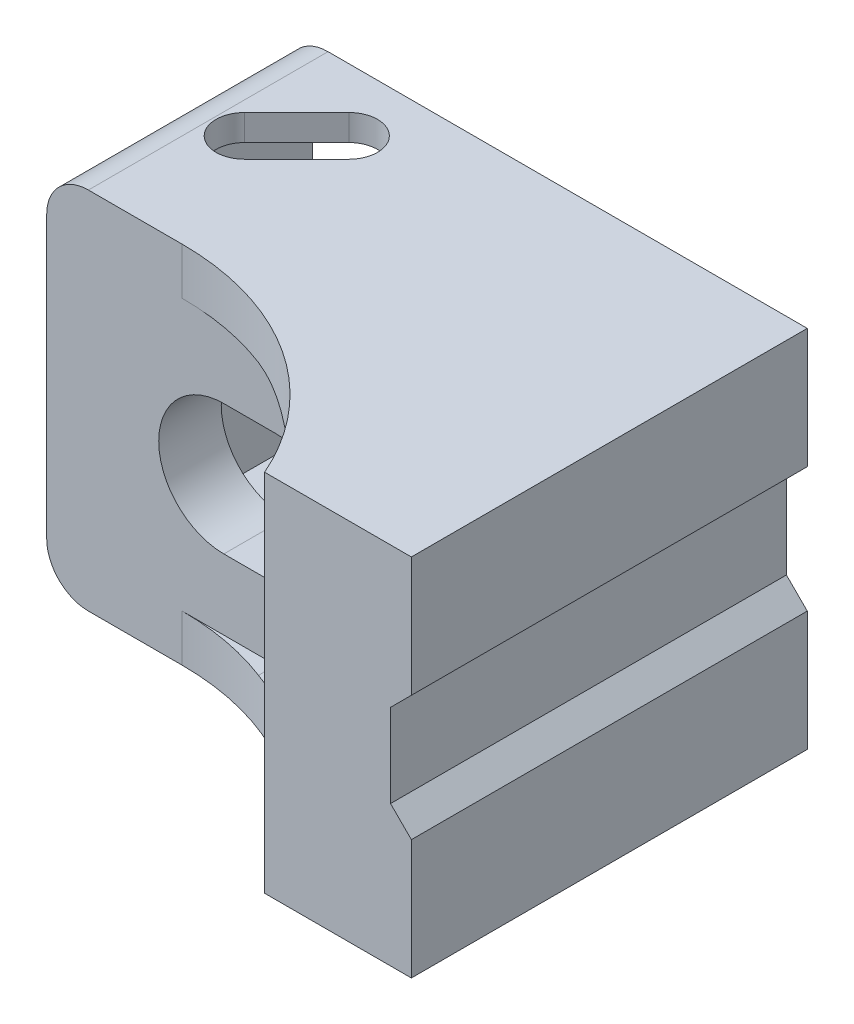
ISO-10303-21;
HEADER;
FILE_DESCRIPTION(('STEP AP214'),'2;1');
FILE_NAME('part.step','',(''),(''),'','','');
FILE_SCHEMA(('AUTOMOTIVE_DESIGN { 1 0 10303 214 1 1 1 1 }'));
ENDSEC;
DATA;
#1=APPLICATION_CONTEXT('core data for automotive mechanical design processes');
#2=APPLICATION_PROTOCOL_DEFINITION('international standard','automotive_design',2000,#1);
#3=PRODUCT_CONTEXT('',#1,'mechanical');
#4=PRODUCT('Part','Part','',(#3));
#5=PRODUCT_RELATED_PRODUCT_CATEGORY('part','',(#4));
#6=PRODUCT_DEFINITION_FORMATION('','',#4);
#7=PRODUCT_DEFINITION_CONTEXT('part definition',#1,'design');
#8=PRODUCT_DEFINITION('design','',#6,#7);
#9=PRODUCT_DEFINITION_SHAPE('','',#8);
#10=(LENGTH_UNIT() NAMED_UNIT(*) SI_UNIT(.MILLI.,.METRE.));
#11=(NAMED_UNIT(*) PLANE_ANGLE_UNIT() SI_UNIT($,.RADIAN.));
#12=(NAMED_UNIT(*) SI_UNIT($,.STERADIAN.) SOLID_ANGLE_UNIT());
#13=UNCERTAINTY_MEASURE_WITH_UNIT(LENGTH_MEASURE(1.E-05),#10,'distance_accuracy_value','');
#14=(GEOMETRIC_REPRESENTATION_CONTEXT(3) GLOBAL_UNCERTAINTY_ASSIGNED_CONTEXT((#13)) GLOBAL_UNIT_ASSIGNED_CONTEXT((#10,
#11,#12)) REPRESENTATION_CONTEXT('',''));
#15=CARTESIAN_POINT('',(0.,0.,0.));
#16=DIRECTION('',(0.,0.,1.));
#17=DIRECTION('',(1.,0.,0.));
#18=AXIS2_PLACEMENT_3D('',#15,#16,#17);
#19=CARTESIAN_POINT('',(28.,-17.5,38.));
#20=DIRECTION('',(0.,1.,0.));
#21=DIRECTION('',(-1.,0.,0.));
#22=AXIS2_PLACEMENT_3D('',#19,#20,#21);
#23=PLANE('',#22);
#24=DIRECTION('',(1.,0.,0.));
#25=VECTOR('',#24,1.);
#26=CARTESIAN_POINT('',(-9.,-17.5,23.));
#27=LINE('',#26,#25);
#28=CARTESIAN_POINT('',(-18.,-17.5,23.));
#29=VERTEX_POINT('',#28);
#30=CARTESIAN_POINT('',(-9.,-17.5,23.));
#31=VERTEX_POINT('',#30);
#32=EDGE_CURVE('E556',#29,#31,#27,.T.);
#33=ORIENTED_EDGE('',*,*,#32,.F.);
#34=DIRECTION('',(0.,0.,1.));
#35=VECTOR('',#34,1.);
#36=CARTESIAN_POINT('',(-18.,-17.5,38.));
#37=LINE('',#36,#35);
#38=CARTESIAN_POINT('',(-18.,-17.5,0.));
#39=VERTEX_POINT('',#38);
#40=EDGE_CURVE('E37',#29,#39,#37,.F.);
#41=ORIENTED_EDGE('',*,*,#40,.T.);
#42=DIRECTION('',(1.,0.,0.));
#43=VECTOR('',#42,1.);
#44=CARTESIAN_POINT('',(28.,-17.5,0.));
#45=LINE('',#44,#43);
#46=CARTESIAN_POINT('',(28.,-17.5,0.));
#47=VERTEX_POINT('',#46);
#48=EDGE_CURVE('E523',#39,#47,#45,.T.);
#49=ORIENTED_EDGE('',*,*,#48,.T.);
#50=DIRECTION('',(0.,0.,-1.));
#51=VECTOR('',#50,1.);
#52=CARTESIAN_POINT('',(28.,-17.5,38.));
#53=LINE('',#52,#51);
#54=CARTESIAN_POINT('',(28.,-17.5,38.));
#55=VERTEX_POINT('',#54);
#56=EDGE_CURVE('E711',#55,#47,#53,.T.);
#57=ORIENTED_EDGE('',*,*,#56,.F.);
#58=DIRECTION('',(1.,0.,0.));
#59=VECTOR('',#58,1.);
#60=CARTESIAN_POINT('',(28.,-17.5,38.));
#61=LINE('',#60,#59);
#62=CARTESIAN_POINT('',(13.9128784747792,-17.5,38.));
#63=VERTEX_POINT('',#62);
#64=EDGE_CURVE('E709',#63,#55,#61,.T.);
#65=ORIENTED_EDGE('',*,*,#64,.F.);
#66=CARTESIAN_POINT('',(-9.,-17.5,48.));
#67=DIRECTION('',(0.,1.,0.));
#68=DIRECTION('',(-1.,0.,0.));
#69=AXIS2_PLACEMENT_3D('',#66,#67,#68);
#70=CIRCLE('',#69,25.);
#71=EDGE_CURVE('E414',#31,#63,#70,.F.);
#72=ORIENTED_EDGE('',*,*,#71,.F.);
#73=EDGE_LOOP('',(#33,#41,#49,#57,#65,#72));
#74=FACE_BOUND('',#73,.T.);
#75=CARTESIAN_POINT('',(-15.,-17.5,11.));
#76=DIRECTION('',(0.,1.,0.));
#77=DIRECTION('',(0.,0.,-1.));
#78=AXIS2_PLACEMENT_3D('',#75,#76,#77);
#79=CIRCLE('',#78,2.75);
#80=CARTESIAN_POINT('',(-16.944543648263,-17.5,9.05545635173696));
#81=VERTEX_POINT('',#80);
#82=CARTESIAN_POINT('',(-13.055456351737,-17.5,12.944543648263));
#83=VERTEX_POINT('',#82);
#84=EDGE_CURVE('E288',#81,#83,#79,.T.);
#85=ORIENTED_EDGE('',*,*,#84,.T.);
#86=DIRECTION('',(0.707106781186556,0.,-0.707106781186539));
#87=VECTOR('',#86,1.);
#88=CARTESIAN_POINT('',(-13.055456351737,-17.5,12.944543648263));
#89=LINE('',#88,#87);
#90=CARTESIAN_POINT('',(-8.05545635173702,-17.5,7.94454364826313));
#91=VERTEX_POINT('',#90);
#92=EDGE_CURVE('E294',#83,#91,#89,.T.);
#93=ORIENTED_EDGE('',*,*,#92,.T.);
#94=CARTESIAN_POINT('',(-10.,-17.5,6.00000000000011));
#95=DIRECTION('',(0.,1.,0.));
#96=DIRECTION('',(0.,0.,-1.));
#97=AXIS2_PLACEMENT_3D('',#94,#95,#96);
#98=CIRCLE('',#97,2.75);
#99=CARTESIAN_POINT('',(-11.944543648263,-17.5,4.05545635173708));
#100=VERTEX_POINT('',#99);
#101=EDGE_CURVE('E314',#91,#100,#98,.T.);
#102=ORIENTED_EDGE('',*,*,#101,.T.);
#103=DIRECTION('',(-0.707106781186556,0.,0.70710678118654));
#104=VECTOR('',#103,1.);
#105=CARTESIAN_POINT('',(-16.944543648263,-17.5,9.05545635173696));
#106=LINE('',#105,#104);
#107=EDGE_CURVE('E306',#100,#81,#106,.T.);
#108=ORIENTED_EDGE('',*,*,#107,.T.);
#109=EDGE_LOOP('',(#85,#93,#102,#108));
#110=FACE_BOUND('',#109,.T.);
#111=ADVANCED_FACE('F14',(#74,#110),#23,.F.);
#112=CARTESIAN_POINT('',(-19.5,-15.,0.));
#113=DIRECTION('',(0.,1.,0.));
#114=DIRECTION('',(0.,0.,-1.));
#115=AXIS2_PLACEMENT_3D('',#112,#113,#114);
#116=PLANE('',#115);
#117=DIRECTION('',(-1.,0.,0.));
#118=VECTOR('',#117,1.);
#119=CARTESIAN_POINT('',(-19.5,-15.,0.));
#120=LINE('',#119,#118);
#121=CARTESIAN_POINT('',(24.7132034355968,-15.,0.));
#122=VERTEX_POINT('',#121);
#123=CARTESIAN_POINT('',(-19.5,-15.,0.));
#124=VERTEX_POINT('',#123);
#125=EDGE_CURVE('E726',#122,#124,#120,.T.);
#126=ORIENTED_EDGE('',*,*,#125,.T.);
#127=DIRECTION('',(0.,0.,1.));
#128=VECTOR('',#127,1.);
#129=CARTESIAN_POINT('',(-19.5,-15.,18.));
#130=LINE('',#129,#128);
#131=CARTESIAN_POINT('',(-19.5,-15.,18.));
#132=VERTEX_POINT('',#131);
#133=EDGE_CURVE('E722',#124,#132,#130,.T.);
#134=ORIENTED_EDGE('',*,*,#133,.T.);
#135=DIRECTION('',(1.,0.,0.));
#136=VECTOR('',#135,1.);
#137=CARTESIAN_POINT('',(-14.5,-15.,18.));
#138=LINE('',#137,#136);
#139=CARTESIAN_POINT('',(-14.5,-15.,18.));
#140=VERTEX_POINT('',#139);
#141=EDGE_CURVE('E725',#132,#140,#138,.T.);
#142=ORIENTED_EDGE('',*,*,#141,.T.);
#143=DIRECTION('',(0.707106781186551,0.,-0.707106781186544));
#144=VECTOR('',#143,1.);
#145=CARTESIAN_POINT('',(-4.49999999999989,-15.,8.));
#146=LINE('',#145,#144);
#147=CARTESIAN_POINT('',(-4.49999999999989,-15.,8.));
#148=VERTEX_POINT('',#147);
#149=EDGE_CURVE('E739',#140,#148,#146,.T.);
#150=ORIENTED_EDGE('',*,*,#149,.T.);
#151=DIRECTION('',(1.,0.,0.));
#152=VECTOR('',#151,1.);
#153=CARTESIAN_POINT('',(16.7132034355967,-15.,8.));
#154=LINE('',#153,#152);
#155=CARTESIAN_POINT('',(16.7132034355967,-15.,8.));
#156=VERTEX_POINT('',#155);
#157=EDGE_CURVE('E742',#148,#156,#154,.T.);
#158=ORIENTED_EDGE('',*,*,#157,.T.);
#159=DIRECTION('',(0.707106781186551,0.,-0.707106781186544));
#160=VECTOR('',#159,1.);
#161=CARTESIAN_POINT('',(24.7132034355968,-15.,0.));
#162=LINE('',#161,#160);
#163=EDGE_CURVE('E631',#156,#122,#162,.T.);
#164=ORIENTED_EDGE('',*,*,#163,.T.);
#165=EDGE_LOOP('',(#126,#134,#142,#150,#158,#164));
#166=FACE_BOUND('',#165,.T.);
#167=DIRECTION('',(-0.707106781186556,0.,0.707106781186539));
#168=VECTOR('',#167,1.);
#169=CARTESIAN_POINT('',(-9.80545635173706,-15.,9.69454364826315));
#170=LINE('',#169,#168);
#171=CARTESIAN_POINT('',(-8.05545635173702,-15.,7.94454364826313));
#172=VERTEX_POINT('',#171);
#173=CARTESIAN_POINT('',(-13.055456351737,-15.,12.944543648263));
#174=VERTEX_POINT('',#173);
#175=EDGE_CURVE('E323',#172,#174,#170,.T.);
#176=ORIENTED_EDGE('',*,*,#175,.T.);
#177=CARTESIAN_POINT('',(-15.,-15.,11.));
#178=DIRECTION('',(0.,1.,0.));
#179=DIRECTION('',(0.,0.,-1.));
#180=AXIS2_PLACEMENT_3D('',#177,#178,#179);
#181=CIRCLE('',#180,2.75);
#182=CARTESIAN_POINT('',(-16.944543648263,-15.,9.05545635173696));
#183=VERTEX_POINT('',#182);
#184=EDGE_CURVE('E291',#174,#183,#181,.F.);
#185=ORIENTED_EDGE('',*,*,#184,.T.);
#186=DIRECTION('',(0.707106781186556,0.,-0.70710678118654));
#187=VECTOR('',#186,1.);
#188=CARTESIAN_POINT('',(-13.694543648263,-15.,5.80545635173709));
#189=LINE('',#188,#187);
#190=CARTESIAN_POINT('',(-11.944543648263,-15.,4.05545635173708));
#191=VERTEX_POINT('',#190);
#192=EDGE_CURVE('E317',#183,#191,#189,.T.);
#193=ORIENTED_EDGE('',*,*,#192,.T.);
#194=CARTESIAN_POINT('',(-10.,-15.,6.00000000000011));
#195=DIRECTION('',(0.,1.,0.));
#196=DIRECTION('',(0.,0.,-1.));
#197=AXIS2_PLACEMENT_3D('',#194,#195,#196);
#198=CIRCLE('',#197,2.75);
#199=EDGE_CURVE('E320',#191,#172,#198,.F.);
#200=ORIENTED_EDGE('',*,*,#199,.T.);
#201=EDGE_LOOP('',(#176,#185,#193,#200));
#202=FACE_BOUND('',#201,.T.);
#203=ADVANCED_FACE('F486',(#166,#202),#116,.T.);
#204=CARTESIAN_POINT('',(28.,-17.5,38.));
#205=DIRECTION('',(-1.,0.,0.));
#206=DIRECTION('',(0.,0.,-1.));
#207=AXIS2_PLACEMENT_3D('',#204,#205,#206);
#208=PLANE('',#207);
#209=DIRECTION('',(0.,1.,0.));
#210=VECTOR('',#209,1.);
#211=CARTESIAN_POINT('',(28.,-17.5,38.));
#212=LINE('',#211,#210);
#213=CARTESIAN_POINT('',(28.,6.,38.));
#214=VERTEX_POINT('',#213);
#215=CARTESIAN_POINT('',(28.,17.5,38.));
#216=VERTEX_POINT('',#215);
#217=EDGE_CURVE('E702',#214,#216,#212,.T.);
#218=ORIENTED_EDGE('',*,*,#217,.F.);
#219=DIRECTION('',(0.,0.,1.));
#220=VECTOR('',#219,1.);
#221=CARTESIAN_POINT('',(28.,6.,-5.00000000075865E-05));
#222=LINE('',#221,#220);
#223=CARTESIAN_POINT('',(28.,6.,0.));
#224=VERTEX_POINT('',#223);
#225=EDGE_CURVE('E337',#224,#214,#222,.T.);
#226=ORIENTED_EDGE('',*,*,#225,.F.);
#227=DIRECTION('',(0.,1.,0.));
#228=VECTOR('',#227,1.);
#229=CARTESIAN_POINT('',(28.,-17.5,0.));
#230=LINE('',#229,#228);
#231=CARTESIAN_POINT('',(28.,17.5,0.));
#232=VERTEX_POINT('',#231);
#233=EDGE_CURVE('E696',#224,#232,#230,.T.);
#234=ORIENTED_EDGE('',*,*,#233,.T.);
#235=DIRECTION('',(0.,0.,-1.));
#236=VECTOR('',#235,1.);
#237=CARTESIAN_POINT('',(28.,17.5,38.));
#238=LINE('',#237,#236);
#239=EDGE_CURVE('E521',#216,#232,#238,.T.);
#240=ORIENTED_EDGE('',*,*,#239,.F.);
#241=EDGE_LOOP('',(#218,#226,#234,#240));
#242=FACE_BOUND('',#241,.T.);
#243=ADVANCED_FACE('F492',(#242),#208,.F.);
#244=CARTESIAN_POINT('',(0.,0.,17.));
#245=DIRECTION('',(0.,0.,-1.));
#246=DIRECTION('',(1.,0.,0.));
#247=AXIS2_PLACEMENT_3D('',#244,#245,#246);
#248=CYLINDRICAL_SURFACE('',#247,9.25);
#249=DIRECTION('',(0.,0.,-1.));
#250=VECTOR('',#249,1.);
#251=CARTESIAN_POINT('',(7.9372539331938,4.75,17.));
#252=LINE('',#251,#250);
#253=CARTESIAN_POINT('',(7.9372539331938,4.75,17.));
#254=VERTEX_POINT('',#253);
#255=CARTESIAN_POINT('',(7.9372539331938,4.75,8.));
#256=VERTEX_POINT('',#255);
#257=EDGE_CURVE('E399',#254,#256,#252,.T.);
#258=ORIENTED_EDGE('',*,*,#257,.F.);
#259=CARTESIAN_POINT('',(0.,0.,17.));
#260=DIRECTION('',(0.,0.,-1.));
#261=DIRECTION('',(1.,0.,0.));
#262=AXIS2_PLACEMENT_3D('',#259,#260,#261);
#263=CIRCLE('',#262,9.25);
#264=CARTESIAN_POINT('',(0.,9.25,17.));
#265=VERTEX_POINT('',#264);
#266=EDGE_CURVE('E646',#265,#254,#263,.T.);
#267=ORIENTED_EDGE('',*,*,#266,.F.);
#268=DIRECTION('',(0.,0.,-1.));
#269=VECTOR('',#268,1.);
#270=CARTESIAN_POINT('',(0.,9.25,17.));
#271=LINE('',#270,#269);
#272=CARTESIAN_POINT('',(0.,9.25,8.));
#273=VERTEX_POINT('',#272);
#274=EDGE_CURVE('E652',#265,#273,#271,.T.);
#275=ORIENTED_EDGE('',*,*,#274,.T.);
#276=CARTESIAN_POINT('',(0.,0.,8.));
#277=DIRECTION('',(0.,0.,1.));
#278=DIRECTION('',(-1.,0.,0.));
#279=AXIS2_PLACEMENT_3D('',#276,#277,#278);
#280=CIRCLE('',#279,9.25);
#281=EDGE_CURVE('E718',#273,#256,#280,.F.);
#282=ORIENTED_EDGE('',*,*,#281,.T.);
#283=EDGE_LOOP('',(#258,#267,#275,#282));
#284=FACE_BOUND('',#283,.T.);
#285=ADVANCED_FACE('F784',(#284),#248,.F.);
#286=DIRECTION('',(0.,0.,-1.));
#287=VECTOR('',#286,1.);
#288=CARTESIAN_POINT('',(7.9372539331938,-4.75,17.));
#289=LINE('',#288,#287);
#290=CARTESIAN_POINT('',(7.9372539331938,-4.75,8.));
#291=VERTEX_POINT('',#290);
#292=CARTESIAN_POINT('',(7.9372539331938,-4.75,17.));
#293=VERTEX_POINT('',#292);
#294=EDGE_CURVE('E397',#291,#293,#289,.F.);
#295=ORIENTED_EDGE('',*,*,#294,.F.);
#296=CARTESIAN_POINT('',(0.,-9.25,8.));
#297=VERTEX_POINT('',#296);
#298=EDGE_CURVE('E717',#291,#297,#280,.F.);
#299=ORIENTED_EDGE('',*,*,#298,.T.);
#300=DIRECTION('',(0.,0.,-1.));
#301=VECTOR('',#300,1.);
#302=CARTESIAN_POINT('',(0.,-9.25,17.));
#303=LINE('',#302,#301);
#304=CARTESIAN_POINT('',(0.,-9.25,17.));
#305=VERTEX_POINT('',#304);
#306=EDGE_CURVE('E653',#305,#297,#303,.T.);
#307=ORIENTED_EDGE('',*,*,#306,.F.);
#308=EDGE_CURVE('E645',#293,#305,#263,.T.);
#309=ORIENTED_EDGE('',*,*,#308,.F.);
#310=EDGE_LOOP('',(#295,#299,#307,#309));
#311=FACE_BOUND('',#310,.T.);
#312=ADVANCED_FACE('F787',(#311),#248,.F.);
#313=CARTESIAN_POINT('',(16.7132034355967,-15.,8.));
#314=DIRECTION('',(0.,0.,1.));
#315=DIRECTION('',(-1.,0.,0.));
#316=AXIS2_PLACEMENT_3D('',#313,#314,#315);
#317=PLANE('',#316);
#318=CARTESIAN_POINT('',(16.,0.,8.));
#319=DIRECTION('',(0.,0.,1.));
#320=DIRECTION('',(-1.,0.,0.));
#321=AXIS2_PLACEMENT_3D('',#318,#319,#320);
#322=CIRCLE('',#321,4.75);
#323=CARTESIAN_POINT('',(16.,4.75,8.));
#324=VERTEX_POINT('',#323);
#325=CARTESIAN_POINT('',(16.7132034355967,4.6961517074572,8.));
#326=VERTEX_POINT('',#325);
#327=EDGE_CURVE('E396',#324,#326,#322,.F.);
#328=ORIENTED_EDGE('',*,*,#327,.F.);
#329=DIRECTION('',(1.,0.,0.));
#330=VECTOR('',#329,1.);
#331=CARTESIAN_POINT('',(16.7132034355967,4.75,8.));
#332=LINE('',#331,#330);
#333=EDGE_CURVE('E596',#256,#324,#332,.T.);
#334=ORIENTED_EDGE('',*,*,#333,.F.);
#335=ORIENTED_EDGE('',*,*,#281,.F.);
#336=DIRECTION('',(1.,0.,0.));
#337=VECTOR('',#336,1.);
#338=CARTESIAN_POINT('',(-19.5,9.25,8.));
#339=LINE('',#338,#337);
#340=CARTESIAN_POINT('',(-4.49999999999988,9.25,8.));
#341=VERTEX_POINT('',#340);
#342=EDGE_CURVE('E635',#341,#273,#339,.T.);
#343=ORIENTED_EDGE('',*,*,#342,.F.);
#344=DIRECTION('',(0.,1.,0.));
#345=VECTOR('',#344,1.);
#346=CARTESIAN_POINT('',(-4.49999999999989,-15.,8.));
#347=LINE('',#346,#345);
#348=CARTESIAN_POINT('',(-4.49999999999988,15.,8.));
#349=VERTEX_POINT('',#348);
#350=EDGE_CURVE('E621',#341,#349,#347,.T.);
#351=ORIENTED_EDGE('',*,*,#350,.T.);
#352=DIRECTION('',(1.,0.,0.));
#353=VECTOR('',#352,1.);
#354=CARTESIAN_POINT('',(16.7132034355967,15.,8.));
#355=LINE('',#354,#353);
#356=CARTESIAN_POINT('',(16.7132034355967,15.,8.));
#357=VERTEX_POINT('',#356);
#358=EDGE_CURVE('E611',#349,#357,#355,.T.);
#359=ORIENTED_EDGE('',*,*,#358,.T.);
#360=DIRECTION('',(0.,1.,0.));
#361=VECTOR('',#360,1.);
#362=CARTESIAN_POINT('',(16.7132034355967,-15.,8.));
#363=LINE('',#362,#361);
#364=EDGE_CURVE('E609',#326,#357,#363,.T.);
#365=ORIENTED_EDGE('',*,*,#364,.F.);
#366=EDGE_LOOP('',(#328,#334,#335,#343,#351,#359,#365));
#367=FACE_BOUND('',#366,.T.);
#368=ADVANCED_FACE('F607',(#367),#317,.F.);
#369=CARTESIAN_POINT('',(16.7132034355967,-4.6961517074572,8.));
#370=VERTEX_POINT('',#369);
#371=CARTESIAN_POINT('',(16.,-4.75,8.));
#372=VERTEX_POINT('',#371);
#373=EDGE_CURVE('E394',#370,#372,#322,.F.);
#374=ORIENTED_EDGE('',*,*,#373,.F.);
#375=EDGE_CURVE('E615',#156,#370,#363,.T.);
#376=ORIENTED_EDGE('',*,*,#375,.F.);
#377=ORIENTED_EDGE('',*,*,#157,.F.);
#378=CARTESIAN_POINT('',(-4.49999999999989,-9.25,8.));
#379=VERTEX_POINT('',#378);
#380=EDGE_CURVE('E616',#148,#379,#347,.T.);
#381=ORIENTED_EDGE('',*,*,#380,.T.);
#382=DIRECTION('',(-1.,0.,0.));
#383=VECTOR('',#382,1.);
#384=CARTESIAN_POINT('',(-19.5,-9.25,8.));
#385=LINE('',#384,#383);
#386=EDGE_CURVE('E632',#297,#379,#385,.T.);
#387=ORIENTED_EDGE('',*,*,#386,.F.);
#388=ORIENTED_EDGE('',*,*,#298,.F.);
#389=DIRECTION('',(-1.,0.,0.));
#390=VECTOR('',#389,1.);
#391=CARTESIAN_POINT('',(16.7132034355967,-4.75,8.));
#392=LINE('',#391,#390);
#393=EDGE_CURVE('E593',#372,#291,#392,.T.);
#394=ORIENTED_EDGE('',*,*,#393,.F.);
#395=EDGE_LOOP('',(#374,#376,#377,#381,#387,#388,#394));
#396=FACE_BOUND('',#395,.T.);
#397=ADVANCED_FACE('F825',(#396),#317,.F.);
#398=CARTESIAN_POINT('',(24.7132034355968,-15.,0.));
#399=DIRECTION('',(0.707106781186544,0.,0.707106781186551));
#400=DIRECTION('',(-0.707106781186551,0.,0.707106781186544));
#401=AXIS2_PLACEMENT_3D('',#398,#399,#400);
#402=PLANE('',#401);
#403=CARTESIAN_POINT('',(16.,0.,8.71320343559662));
#404=DIRECTION('',(0.707106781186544,0.,0.707106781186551));
#405=DIRECTION('',(0.707106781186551,0.,-0.707106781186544));
#406=AXIS2_PLACEMENT_3D('',#403,#404,#405);
#407=ELLIPSE('',#406,6.71751442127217,4.75);
#408=EDGE_CURVE('E591',#326,#370,#407,.F.);
#409=ORIENTED_EDGE('',*,*,#408,.F.);
#410=ORIENTED_EDGE('',*,*,#364,.T.);
#411=DIRECTION('',(0.707106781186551,0.,-0.707106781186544));
#412=VECTOR('',#411,1.);
#413=CARTESIAN_POINT('',(24.7132034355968,15.,0.));
#414=LINE('',#413,#412);
#415=CARTESIAN_POINT('',(24.7132034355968,15.,0.));
#416=VERTEX_POINT('',#415);
#417=EDGE_CURVE('E729',#357,#416,#414,.T.);
#418=ORIENTED_EDGE('',*,*,#417,.T.);
#419=DIRECTION('',(0.,1.,0.));
#420=VECTOR('',#419,1.);
#421=CARTESIAN_POINT('',(24.7132034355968,-15.,0.));
#422=LINE('',#421,#420);
#423=EDGE_CURVE('E619',#122,#416,#422,.T.);
#424=ORIENTED_EDGE('',*,*,#423,.F.);
#425=ORIENTED_EDGE('',*,*,#163,.F.);
#426=ORIENTED_EDGE('',*,*,#375,.T.);
#427=EDGE_LOOP('',(#409,#410,#418,#424,#425,#426));
#428=FACE_BOUND('',#427,.T.);
#429=ADVANCED_FACE('F820',(#428),#402,.F.);
#430=CARTESIAN_POINT('',(28.,17.5,0.));
#431=DIRECTION('',(0.,0.,1.));
#432=DIRECTION('',(-1.,0.,0.));
#433=AXIS2_PLACEMENT_3D('',#430,#431,#432);
#434=PLANE('',#433);
#435=ORIENTED_EDGE('',*,*,#48,.F.);
#436=CARTESIAN_POINT('',(-18.,-13.5,0.));
#437=DIRECTION('',(0.,0.,1.));
#438=DIRECTION('',(-1.,0.,0.));
#439=AXIS2_PLACEMENT_3D('',#436,#437,#438);
#440=CIRCLE('',#439,4.);
#441=CARTESIAN_POINT('',(-22.,-13.5,0.));
#442=VERTEX_POINT('',#441);
#443=EDGE_CURVE('E22',#39,#442,#440,.F.);
#444=ORIENTED_EDGE('',*,*,#443,.T.);
#445=DIRECTION('',(0.,-1.,0.));
#446=VECTOR('',#445,1.);
#447=CARTESIAN_POINT('',(-22.,17.5,0.));
#448=LINE('',#447,#446);
#449=CARTESIAN_POINT('',(-22.,13.5,0.));
#450=VERTEX_POINT('',#449);
#451=EDGE_CURVE('E546',#450,#442,#448,.T.);
#452=ORIENTED_EDGE('',*,*,#451,.F.);
#453=CARTESIAN_POINT('',(-18.,13.5,0.));
#454=DIRECTION('',(0.,0.,1.));
#455=DIRECTION('',(-1.,0.,0.));
#456=AXIS2_PLACEMENT_3D('',#453,#454,#455);
#457=CIRCLE('',#456,4.);
#458=CARTESIAN_POINT('',(-18.,17.5,0.));
#459=VERTEX_POINT('',#458);
#460=EDGE_CURVE('E29',#450,#459,#457,.F.);
#461=ORIENTED_EDGE('',*,*,#460,.T.);
#462=DIRECTION('',(-1.,0.,0.));
#463=VECTOR('',#462,1.);
#464=CARTESIAN_POINT('',(28.,17.5,0.));
#465=LINE('',#464,#463);
#466=EDGE_CURVE('E515',#232,#459,#465,.T.);
#467=ORIENTED_EDGE('',*,*,#466,.F.);
#468=ORIENTED_EDGE('',*,*,#233,.F.);
#469=DIRECTION('',(-0.707106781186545,-0.707106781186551,0.));
#470=VECTOR('',#469,1.);
#471=CARTESIAN_POINT('',(33.75,11.75,0.));
#472=LINE('',#471,#470);
#473=CARTESIAN_POINT('',(26.,4.,0.));
#474=VERTEX_POINT('',#473);
#475=EDGE_CURVE('E346',#224,#474,#472,.T.);
#476=ORIENTED_EDGE('',*,*,#475,.T.);
#477=DIRECTION('',(0.,-1.,0.));
#478=VECTOR('',#477,1.);
#479=CARTESIAN_POINT('',(26.,17.5,0.));
#480=LINE('',#479,#478);
#481=CARTESIAN_POINT('',(26.,-4.,0.));
#482=VERTEX_POINT('',#481);
#483=EDGE_CURVE('E349',#474,#482,#480,.T.);
#484=ORIENTED_EDGE('',*,*,#483,.T.);
#485=DIRECTION('',(0.707106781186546,-0.707106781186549,0.));
#486=VECTOR('',#485,1.);
#487=CARTESIAN_POINT('',(16.25,5.75,0.));
#488=LINE('',#487,#486);
#489=CARTESIAN_POINT('',(28.,-6.,0.));
#490=VERTEX_POINT('',#489);
#491=EDGE_CURVE('E336',#482,#490,#488,.T.);
#492=ORIENTED_EDGE('',*,*,#491,.T.);
#493=EDGE_CURVE('E524',#47,#490,#230,.T.);
#494=ORIENTED_EDGE('',*,*,#493,.F.);
#495=EDGE_LOOP('',(#435,#444,#452,#461,#467,#468,#476,#484,#492,#494));
#496=FACE_BOUND('',#495,.T.);
#497=ORIENTED_EDGE('',*,*,#125,.F.);
#498=ORIENTED_EDGE('',*,*,#423,.T.);
#499=DIRECTION('',(-1.,0.,0.));
#500=VECTOR('',#499,1.);
#501=CARTESIAN_POINT('',(-19.5,15.,0.));
#502=LINE('',#501,#500);
#503=CARTESIAN_POINT('',(-19.5,15.,0.));
#504=VERTEX_POINT('',#503);
#505=EDGE_CURVE('E551',#416,#504,#502,.T.);
#506=ORIENTED_EDGE('',*,*,#505,.T.);
#507=DIRECTION('',(0.,-1.,0.));
#508=VECTOR('',#507,1.);
#509=CARTESIAN_POINT('',(-19.5,17.5,0.));
#510=LINE('',#509,#508);
#511=EDGE_CURVE('E552',#504,#124,#510,.T.);
#512=ORIENTED_EDGE('',*,*,#511,.T.);
#513=EDGE_LOOP('',(#497,#498,#506,#512));
#514=FACE_BOUND('',#513,.T.);
#515=ADVANCED_FACE('F544',(#496,#514),#434,.F.);
#516=CARTESIAN_POINT('',(-5.,0.,0.));
#517=DIRECTION('',(0.,0.,1.));
#518=DIRECTION('',(-1.,0.,0.));
#519=AXIS2_PLACEMENT_3D('',#516,#517,#518);
#520=CYLINDRICAL_SURFACE('',#519,6.25);
#521=CARTESIAN_POINT('',(-5.,0.,17.));
#522=DIRECTION('',(0.,0.,-1.));
#523=DIRECTION('',(1.,0.,0.));
#524=AXIS2_PLACEMENT_3D('',#521,#522,#523);
#525=CIRCLE('',#524,6.25);
#526=CARTESIAN_POINT('',(-5.,6.25,17.));
#527=VERTEX_POINT('',#526);
#528=CARTESIAN_POINT('',(-5.,-6.25,17.));
#529=VERTEX_POINT('',#528);
#530=EDGE_CURVE('E662',#527,#529,#525,.F.);
#531=ORIENTED_EDGE('',*,*,#530,.F.);
#532=DIRECTION('',(0.,0.,1.));
#533=VECTOR('',#532,1.);
#534=CARTESIAN_POINT('',(-5.,6.25,0.));
#535=LINE('',#534,#533);
#536=CARTESIAN_POINT('',(-5.,6.25,23.));
#537=VERTEX_POINT('',#536);
#538=EDGE_CURVE('E677',#527,#537,#535,.T.);
#539=ORIENTED_EDGE('',*,*,#538,.T.);
#540=CARTESIAN_POINT('',(-5.,0.,23.));
#541=DIRECTION('',(0.,0.,1.));
#542=DIRECTION('',(1.,0.,0.));
#543=AXIS2_PLACEMENT_3D('',#540,#541,#542);
#544=CIRCLE('',#543,6.25);
#545=CARTESIAN_POINT('',(-5.,-6.25,23.));
#546=VERTEX_POINT('',#545);
#547=EDGE_CURVE('E664',#537,#546,#544,.T.);
#548=ORIENTED_EDGE('',*,*,#547,.T.);
#549=DIRECTION('',(0.,0.,1.));
#550=VECTOR('',#549,1.);
#551=CARTESIAN_POINT('',(-5.,-6.25,0.));
#552=LINE('',#551,#550);
#553=EDGE_CURVE('E676',#529,#546,#552,.T.);
#554=ORIENTED_EDGE('',*,*,#553,.F.);
#555=EDGE_LOOP('',(#531,#539,#548,#554));
#556=FACE_BOUND('',#555,.T.);
#557=ADVANCED_FACE('F796',(#556),#520,.F.);
#558=CARTESIAN_POINT('',(-5.,6.25,0.));
#559=DIRECTION('',(0.,1.,0.));
#560=DIRECTION('',(0.,0.,-1.));
#561=AXIS2_PLACEMENT_3D('',#558,#559,#560);
#562=PLANE('',#561);
#563=DIRECTION('',(-1.,0.,0.));
#564=VECTOR('',#563,1.);
#565=CARTESIAN_POINT('',(-5.,6.25,17.));
#566=LINE('',#565,#564);
#567=CARTESIAN_POINT('',(0.,6.25,17.));
#568=VERTEX_POINT('',#567);
#569=EDGE_CURVE('E660',#568,#527,#566,.T.);
#570=ORIENTED_EDGE('',*,*,#569,.F.);
#571=DIRECTION('',(0.,0.,1.));
#572=VECTOR('',#571,1.);
#573=CARTESIAN_POINT('',(0.,6.25,0.));
#574=LINE('',#573,#572);
#575=CARTESIAN_POINT('',(0.,6.25,23.));
#576=VERTEX_POINT('',#575);
#577=EDGE_CURVE('E680',#568,#576,#574,.T.);
#578=ORIENTED_EDGE('',*,*,#577,.T.);
#579=DIRECTION('',(-1.,0.,0.));
#580=VECTOR('',#579,1.);
#581=CARTESIAN_POINT('',(-5.,6.25,23.));
#582=LINE('',#581,#580);
#583=EDGE_CURVE('E673',#576,#537,#582,.T.);
#584=ORIENTED_EDGE('',*,*,#583,.T.);
#585=ORIENTED_EDGE('',*,*,#538,.F.);
#586=EDGE_LOOP('',(#570,#578,#584,#585));
#587=FACE_BOUND('',#586,.T.);
#588=ADVANCED_FACE('F792',(#587),#562,.F.);
#589=CARTESIAN_POINT('',(0.,0.,0.));
#590=DIRECTION('',(0.,0.,1.));
#591=DIRECTION('',(-1.,0.,0.));
#592=AXIS2_PLACEMENT_3D('',#589,#590,#591);
#593=CYLINDRICAL_SURFACE('',#592,6.25);
#594=CARTESIAN_POINT('',(0.,0.,17.));
#595=DIRECTION('',(0.,0.,-1.));
#596=DIRECTION('',(1.,0.,0.));
#597=AXIS2_PLACEMENT_3D('',#594,#595,#596);
#598=CIRCLE('',#597,6.25);
#599=CARTESIAN_POINT('',(0.,-6.25,17.));
#600=VERTEX_POINT('',#599);
#601=EDGE_CURVE('E656',#600,#568,#598,.F.);
#602=ORIENTED_EDGE('',*,*,#601,.F.);
#603=DIRECTION('',(0.,0.,1.));
#604=VECTOR('',#603,1.);
#605=CARTESIAN_POINT('',(0.,-6.25,0.));
#606=LINE('',#605,#604);
#607=CARTESIAN_POINT('',(0.,-6.25,23.));
#608=VERTEX_POINT('',#607);
#609=EDGE_CURVE('E682',#600,#608,#606,.T.);
#610=ORIENTED_EDGE('',*,*,#609,.T.);
#611=CARTESIAN_POINT('',(0.,0.,23.));
#612=DIRECTION('',(0.,0.,1.));
#613=DIRECTION('',(-1.,0.,0.));
#614=AXIS2_PLACEMENT_3D('',#611,#612,#613);
#615=CIRCLE('',#614,6.25);
#616=EDGE_CURVE('E670',#608,#576,#615,.T.);
#617=ORIENTED_EDGE('',*,*,#616,.T.);
#618=ORIENTED_EDGE('',*,*,#577,.F.);
#619=EDGE_LOOP('',(#602,#610,#617,#618));
#620=FACE_BOUND('',#619,.T.);
#621=ADVANCED_FACE('F795',(#620),#593,.F.);
#622=CARTESIAN_POINT('',(-5.,-6.25,0.));
#623=DIRECTION('',(0.,-1.,0.));
#624=DIRECTION('',(0.,0.,1.));
#625=AXIS2_PLACEMENT_3D('',#622,#623,#624);
#626=PLANE('',#625);
#627=DIRECTION('',(1.,0.,0.));
#628=VECTOR('',#627,1.);
#629=CARTESIAN_POINT('',(-5.,-6.25,17.));
#630=LINE('',#629,#628);
#631=EDGE_CURVE('E715',#529,#600,#630,.T.);
#632=ORIENTED_EDGE('',*,*,#631,.F.);
#633=ORIENTED_EDGE('',*,*,#553,.T.);
#634=DIRECTION('',(1.,0.,0.));
#635=VECTOR('',#634,1.);
#636=CARTESIAN_POINT('',(-5.,-6.25,23.));
#637=LINE('',#636,#635);
#638=EDGE_CURVE('E667',#546,#608,#637,.T.);
#639=ORIENTED_EDGE('',*,*,#638,.T.);
#640=ORIENTED_EDGE('',*,*,#609,.F.);
#641=EDGE_LOOP('',(#632,#633,#639,#640));
#642=FACE_BOUND('',#641,.T.);
#643=ADVANCED_FACE('F508',(#642),#626,.F.);
#644=ORIENTED_EDGE('',*,*,#493,.T.);
#645=DIRECTION('',(0.,0.,1.));
#646=VECTOR('',#645,1.);
#647=CARTESIAN_POINT('',(28.,-6.,-5.00000000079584E-05));
#648=LINE('',#647,#646);
#649=CARTESIAN_POINT('',(28.,-6.,38.));
#650=VERTEX_POINT('',#649);
#651=EDGE_CURVE('E339',#490,#650,#648,.T.);
#652=ORIENTED_EDGE('',*,*,#651,.T.);
#653=EDGE_CURVE('E703',#55,#650,#212,.T.);
#654=ORIENTED_EDGE('',*,*,#653,.F.);
#655=ORIENTED_EDGE('',*,*,#56,.T.);
#656=EDGE_LOOP('',(#644,#652,#654,#655));
#657=FACE_BOUND('',#656,.T.);
#658=ADVANCED_FACE('F16',(#657),#208,.F.);
#659=CARTESIAN_POINT('',(28.,17.5,38.));
#660=DIRECTION('',(0.,-1.,0.));
#661=DIRECTION('',(1.,0.,0.));
#662=AXIS2_PLACEMENT_3D('',#659,#660,#661);
#663=PLANE('',#662);
#664=DIRECTION('',(0.707106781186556,0.,-0.707106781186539));
#665=VECTOR('',#664,1.);
#666=CARTESIAN_POINT('',(-13.055456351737,17.5,12.944543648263));
#667=LINE('',#666,#665);
#668=CARTESIAN_POINT('',(-13.055456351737,17.5,12.944543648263));
#669=VERTEX_POINT('',#668);
#670=CARTESIAN_POINT('',(-8.05545635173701,17.5,7.94454364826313));
#671=VERTEX_POINT('',#670);
#672=EDGE_CURVE('E363',#669,#671,#667,.T.);
#673=ORIENTED_EDGE('',*,*,#672,.F.);
#674=CARTESIAN_POINT('',(-15.,17.5,11.));
#675=DIRECTION('',(0.,1.,0.));
#676=DIRECTION('',(0.,0.,-1.));
#677=AXIS2_PLACEMENT_3D('',#674,#675,#676);
#678=CIRCLE('',#677,2.75);
#679=CARTESIAN_POINT('',(-16.944543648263,17.5,9.05545635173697));
#680=VERTEX_POINT('',#679);
#681=EDGE_CURVE('E352',#680,#669,#678,.T.);
#682=ORIENTED_EDGE('',*,*,#681,.F.);
#683=DIRECTION('',(-0.707106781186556,0.,0.70710678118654));
#684=VECTOR('',#683,1.);
#685=CARTESIAN_POINT('',(-16.944543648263,17.5,9.05545635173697));
#686=LINE('',#685,#684);
#687=CARTESIAN_POINT('',(-11.944543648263,17.5,4.05545635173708));
#688=VERTEX_POINT('',#687);
#689=EDGE_CURVE('E369',#688,#680,#686,.T.);
#690=ORIENTED_EDGE('',*,*,#689,.F.);
#691=CARTESIAN_POINT('',(-10.,17.5,6.00000000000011));
#692=DIRECTION('',(0.,1.,0.));
#693=DIRECTION('',(0.,0.,-1.));
#694=AXIS2_PLACEMENT_3D('',#691,#692,#693);
#695=CIRCLE('',#694,2.75);
#696=EDGE_CURVE('E366',#671,#688,#695,.T.);
#697=ORIENTED_EDGE('',*,*,#696,.F.);
#698=EDGE_LOOP('',(#673,#682,#690,#697));
#699=FACE_BOUND('',#698,.T.);
#700=ORIENTED_EDGE('',*,*,#466,.T.);
#701=DIRECTION('',(0.,0.,-1.));
#702=VECTOR('',#701,1.);
#703=CARTESIAN_POINT('',(-18.,17.5,38.));
#704=LINE('',#703,#702);
#705=CARTESIAN_POINT('',(-18.,17.5,23.));
#706=VERTEX_POINT('',#705);
#707=EDGE_CURVE('E9',#459,#706,#704,.F.);
#708=ORIENTED_EDGE('',*,*,#707,.T.);
#709=DIRECTION('',(-1.,0.,0.));
#710=VECTOR('',#709,1.);
#711=CARTESIAN_POINT('',(-9.,17.5,23.));
#712=LINE('',#711,#710);
#713=CARTESIAN_POINT('',(-9.,17.5,23.));
#714=VERTEX_POINT('',#713);
#715=EDGE_CURVE('E563',#714,#706,#712,.T.);
#716=ORIENTED_EDGE('',*,*,#715,.F.);
#717=CARTESIAN_POINT('',(-9.,17.5,48.));
#718=DIRECTION('',(0.,1.,0.));
#719=DIRECTION('',(0.,0.,-1.));
#720=AXIS2_PLACEMENT_3D('',#717,#718,#719);
#721=CIRCLE('',#720,25.);
#722=CARTESIAN_POINT('',(13.9128784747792,17.5,38.));
#723=VERTEX_POINT('',#722);
#724=EDGE_CURVE('E561',#723,#714,#721,.T.);
#725=ORIENTED_EDGE('',*,*,#724,.F.);
#726=DIRECTION('',(-1.,0.,0.));
#727=VECTOR('',#726,1.);
#728=CARTESIAN_POINT('',(28.,17.5,38.));
#729=LINE('',#728,#727);
#730=EDGE_CURVE('E706',#216,#723,#729,.T.);
#731=ORIENTED_EDGE('',*,*,#730,.F.);
#732=ORIENTED_EDGE('',*,*,#239,.T.);
#733=EDGE_LOOP('',(#700,#708,#716,#725,#731,#732));
#734=FACE_BOUND('',#733,.T.);
#735=ADVANCED_FACE('F498',(#699,#734),#663,.F.);
#736=CARTESIAN_POINT('',(28.,17.5,38.));
#737=DIRECTION('',(0.,0.,1.));
#738=DIRECTION('',(-1.,0.,0.));
#739=AXIS2_PLACEMENT_3D('',#736,#737,#738);
#740=PLANE('',#739);
#741=DIRECTION('',(-0.707106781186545,-0.707106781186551,0.));
#742=VECTOR('',#741,1.);
#743=CARTESIAN_POINT('',(26.,4.,38.));
#744=LINE('',#743,#742);
#745=CARTESIAN_POINT('',(26.,4.,38.));
#746=VERTEX_POINT('',#745);
#747=EDGE_CURVE('E330',#214,#746,#744,.T.);
#748=ORIENTED_EDGE('',*,*,#747,.F.);
#749=ORIENTED_EDGE('',*,*,#217,.T.);
#750=ORIENTED_EDGE('',*,*,#730,.T.);
#751=DIRECTION('',(0.,1.,0.));
#752=VECTOR('',#751,1.);
#753=CARTESIAN_POINT('',(13.9128784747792,-17.501,38.));
#754=LINE('',#753,#752);
#755=EDGE_CURVE('E567',#63,#723,#754,.T.);
#756=ORIENTED_EDGE('',*,*,#755,.F.);
#757=ORIENTED_EDGE('',*,*,#64,.T.);
#758=ORIENTED_EDGE('',*,*,#653,.T.);
#759=DIRECTION('',(0.707106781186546,-0.707106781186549,0.));
#760=VECTOR('',#759,1.);
#761=CARTESIAN_POINT('',(26.,-4.,38.));
#762=LINE('',#761,#760);
#763=CARTESIAN_POINT('',(26.,-4.,38.));
#764=VERTEX_POINT('',#763);
#765=EDGE_CURVE('E328',#764,#650,#762,.T.);
#766=ORIENTED_EDGE('',*,*,#765,.F.);
#767=DIRECTION('',(0.,-1.,0.));
#768=VECTOR('',#767,1.);
#769=CARTESIAN_POINT('',(26.,4.,38.));
#770=LINE('',#769,#768);
#771=EDGE_CURVE('E326',#746,#764,#770,.T.);
#772=ORIENTED_EDGE('',*,*,#771,.F.);
#773=EDGE_LOOP('',(#748,#749,#750,#756,#757,#758,#766,#772));
#774=FACE_BOUND('',#773,.T.);
#775=ADVANCED_FACE('F496',(#774),#740,.T.);
#776=CARTESIAN_POINT('',(0.,0.,23.));
#777=DIRECTION('',(0.,0.,1.));
#778=DIRECTION('',(-1.,0.,0.));
#779=AXIS2_PLACEMENT_3D('',#776,#777,#778);
#780=CYLINDRICAL_SURFACE('',#779,13.);
#781=DIRECTION('',(0.,0.,1.));
#782=VECTOR('',#781,1.);
#783=CARTESIAN_POINT('',(0.,-13.,23.));
#784=LINE('',#783,#782);
#785=CARTESIAN_POINT('',(0.,-13.,23.));
#786=VERTEX_POINT('',#785);
#787=CARTESIAN_POINT('',(0.,-13.0000000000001,24.6761924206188));
#788=VERTEX_POINT('',#787);
#789=EDGE_CURVE('E693',#786,#788,#784,.T.);
#790=ORIENTED_EDGE('',*,*,#789,.T.);
#791=CARTESIAN_POINT('',(-9.,9.38083151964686,23.));
#792=CARTESIAN_POINT('',(-8.75539570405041,9.61556817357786,22.999981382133));
#793=CARTESIAN_POINT('',(-8.5015244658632,9.84069509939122,23.0035886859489));
#794=CARTESIAN_POINT('',(-7.97709884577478,10.2703708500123,23.0195625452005));
#795=CARTESIAN_POINT('',(-7.70654080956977,10.4749151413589,23.0319310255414));
#796=CARTESIAN_POINT('',(-7.15084245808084,10.8618644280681,23.0669271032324));
#797=CARTESIAN_POINT('',(-6.86570960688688,11.0442805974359,23.0895494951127));
#798=CARTESIAN_POINT('',(-6.28298159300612,11.3858758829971,23.146359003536));
#799=CARTESIAN_POINT('',(-5.98538775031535,11.5450574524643,23.180544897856));
#800=CARTESIAN_POINT('',(-5.37949751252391,11.8395396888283,23.2616580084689));
#801=CARTESIAN_POINT('',(-5.07118007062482,11.9747898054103,23.3086116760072));
#802=CARTESIAN_POINT('',(-4.44703729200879,12.2203241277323,23.416045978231));
#803=CARTESIAN_POINT('',(-4.13121168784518,12.3306074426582,23.4765270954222));
#804=CARTESIAN_POINT('',(-3.49505531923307,12.5257811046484,23.6114532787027));
#805=CARTESIAN_POINT('',(-3.17472875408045,12.6106936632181,23.6858860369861));
#806=CARTESIAN_POINT('',(-2.5320085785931,12.75529042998,23.8489131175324));
#807=CARTESIAN_POINT('',(-2.20961500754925,12.814975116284,23.9375071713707));
#808=CARTESIAN_POINT('',(-1.57122416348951,12.9086577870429,24.1269579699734));
#809=CARTESIAN_POINT('',(-1.25521722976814,12.9431033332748,24.2275622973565));
#810=CARTESIAN_POINT('',(-0.625995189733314,12.9887504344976,24.4418483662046));
#811=CARTESIAN_POINT('',(-0.312780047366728,12.9999522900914,24.5555299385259));
#812=CARTESIAN_POINT('',(0.309028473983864,13.0000474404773,24.7954074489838));
#813=CARTESIAN_POINT('',(0.617618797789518,12.9889265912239,24.9216112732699));
#814=CARTESIAN_POINT('',(1.22823866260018,12.9454677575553,25.1856666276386));
#815=CARTESIAN_POINT('',(1.53026786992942,12.9131286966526,25.3235187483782));
#816=CARTESIAN_POINT('',(2.14980742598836,12.8251231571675,25.6212372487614));
#817=CARTESIAN_POINT('',(2.46666223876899,12.7678192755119,25.7819823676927));
#818=CARTESIAN_POINT('',(3.08959961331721,12.6315498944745,26.114701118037));
#819=CARTESIAN_POINT('',(3.39568188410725,12.55258381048,26.2866750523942));
#820=CARTESIAN_POINT('',(3.99596615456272,12.3745808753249,26.6405468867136));
#821=CARTESIAN_POINT('',(4.29016954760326,12.2755463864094,26.822443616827));
#822=CARTESIAN_POINT('',(4.86599742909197,12.0588861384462,27.1949100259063));
#823=CARTESIAN_POINT('',(5.14761943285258,11.9412567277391,27.385481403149));
#824=CARTESIAN_POINT('',(5.824276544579,11.6306944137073,27.8634064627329));
#825=CARTESIAN_POINT('',(6.2119081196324,11.4280082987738,28.154964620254));
#826=CARTESIAN_POINT('',(6.9582846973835,10.9895299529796,28.7500346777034));
#827=CARTESIAN_POINT('',(7.31701791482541,10.753724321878,29.0535513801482));
#828=CARTESIAN_POINT('',(8.00650108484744,10.2507934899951,29.6698730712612));
#829=CARTESIAN_POINT('',(8.33713249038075,9.9835459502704,29.9827105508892));
#830=CARTESIAN_POINT('',(8.96858251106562,9.42037706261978,30.6123958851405));
#831=CARTESIAN_POINT('',(9.26940739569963,9.12446177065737,30.9292428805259));
#832=CARTESIAN_POINT('',(9.84590913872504,8.49951974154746,31.5677225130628));
#833=CARTESIAN_POINT('',(10.1210882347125,8.1700266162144,31.889347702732));
#834=CARTESIAN_POINT('',(10.6403503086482,7.48125671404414,32.5266233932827));
#835=CARTESIAN_POINT('',(10.8844122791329,7.12196008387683,32.8422697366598));
#836=CARTESIAN_POINT('',(11.2254039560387,6.56032302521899,33.3040968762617));
#837=CARTESIAN_POINT('',(11.3346407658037,6.36983609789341,33.4557319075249));
#838=CARTESIAN_POINT('',(11.5447861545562,5.98054137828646,33.7541229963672));
#839=CARTESIAN_POINT('',(11.6456938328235,5.78173268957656,33.9008785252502));
#840=CARTESIAN_POINT('',(11.8386334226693,5.37561347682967,34.1876436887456));
#841=CARTESIAN_POINT('',(11.9306779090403,5.16831561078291,34.3276627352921));
#842=CARTESIAN_POINT('',(12.1054880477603,4.74444011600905,34.5990893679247));
#843=CARTESIAN_POINT('',(12.188256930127,4.52786575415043,34.7304999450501));
#844=CARTESIAN_POINT('',(12.3273279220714,4.13172974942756,34.955511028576));
#845=CARTESIAN_POINT('',(12.3855229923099,3.9540425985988,35.0512252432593));
#846=CARTESIAN_POINT('',(12.4952127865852,3.59241266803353,35.2341388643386));
#847=CARTESIAN_POINT('',(12.5467081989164,3.40847053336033,35.3213391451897));
#848=CARTESIAN_POINT('',(12.6902540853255,2.84712881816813,35.5674283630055));
#849=CARTESIAN_POINT('',(12.7715447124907,2.45970998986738,35.7111025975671));
#850=CARTESIAN_POINT('',(12.8680132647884,1.85911762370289,35.8841220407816));
#851=CARTESIAN_POINT('',(12.8960389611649,1.65402750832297,35.9349345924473));
#852=CARTESIAN_POINT('',(12.9424797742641,1.2392318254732,36.019602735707));
#853=CARTESIAN_POINT('',(12.9608957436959,1.02952666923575,36.0534598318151));
#854=CARTESIAN_POINT('',(12.9875104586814,0.607609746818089,36.1025138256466));
#855=CARTESIAN_POINT('',(12.9957248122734,0.395402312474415,36.1177392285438));
#856=CARTESIAN_POINT('',(13.001702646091,-0.0296625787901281,36.1288109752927));
#857=CARTESIAN_POINT('',(12.9994673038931,-0.242519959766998,36.1246595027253));
#858=CARTESIAN_POINT('',(12.9856675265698,-0.637041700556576,36.0991354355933));
#859=CARTESIAN_POINT('',(12.9754457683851,-0.818921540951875,36.0802418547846));
#860=CARTESIAN_POINT('',(12.9475802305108,-1.18025905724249,36.0290112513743));
#861=CARTESIAN_POINT('',(12.9299336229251,-1.3597157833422,35.9966691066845));
#862=CARTESIAN_POINT('',(12.8875899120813,-1.71526040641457,35.9196303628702));
#863=CARTESIAN_POINT('',(12.8628862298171,-1.89134499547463,35.8749222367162));
#864=CARTESIAN_POINT('',(12.8068966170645,-2.23930248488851,35.7745117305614));
#865=CARTESIAN_POINT('',(12.7756085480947,-2.411173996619,35.7188057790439));
#866=CARTESIAN_POINT('',(12.6881255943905,-2.84308163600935,35.5646968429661));
#867=CARTESIAN_POINT('',(12.6276716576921,-3.09988292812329,35.4596127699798));
#868=CARTESIAN_POINT('',(12.4937708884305,-3.60184255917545,35.2314719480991));
#869=CARTESIAN_POINT('',(12.4203164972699,-3.8469940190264,35.1084047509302));
#870=CARTESIAN_POINT('',(12.2615153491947,-4.32657173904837,34.8481463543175));
#871=CARTESIAN_POINT('',(12.1761354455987,-4.56096559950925,34.7109160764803));
#872=CARTESIAN_POINT('',(11.9946457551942,-5.0188744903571,34.4260012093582));
#873=CARTESIAN_POINT('',(11.8985367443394,-5.24239030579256,34.2783173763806));
#874=CARTESIAN_POINT('',(11.6196482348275,-5.84492021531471,33.8602563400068));
#875=CARTESIAN_POINT('',(11.4263739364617,-6.21343796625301,33.5816982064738));
#876=CARTESIAN_POINT('',(11.0111630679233,-6.92265479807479,33.0107245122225));
#877=CARTESIAN_POINT('',(10.7892063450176,-7.2633340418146,32.7182993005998));
#878=CARTESIAN_POINT('',(10.3175288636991,-7.91908107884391,32.1262314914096));
#879=CARTESIAN_POINT('',(10.0677749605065,-8.23411750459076,31.8265806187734));
#880=CARTESIAN_POINT('',(9.54129395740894,-8.83879719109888,31.225613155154));
#881=CARTESIAN_POINT('',(9.26457356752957,-9.12844673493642,30.9242969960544));
#882=CARTESIAN_POINT('',(8.66881752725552,-9.69690684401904,30.308018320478));
#883=CARTESIAN_POINT('',(8.34831375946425,-9.97432057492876,29.9931828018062));
#884=CARTESIAN_POINT('',(7.67754909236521,-10.499363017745,29.3702145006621));
#885=CARTESIAN_POINT('',(7.3272831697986,-10.7469866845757,29.0620828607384));
#886=CARTESIAN_POINT('',(6.59803437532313,-11.2094595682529,28.4570894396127));
#887=CARTESIAN_POINT('',(6.21910971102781,-11.4243726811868,28.1602065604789));
#888=CARTESIAN_POINT('',(5.43271538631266,-11.8185826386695,27.5810146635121));
#889=CARTESIAN_POINT('',(5.02525608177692,-11.9978923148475,27.2987004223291));
#890=CARTESIAN_POINT('',(4.28998452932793,-12.2763593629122,26.821785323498));
#891=CARTESIAN_POINT('',(3.96814271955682,-12.3843144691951,26.6230811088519));
#892=CARTESIAN_POINT('',(3.3104229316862,-12.5761038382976,26.2376778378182));
#893=CARTESIAN_POINT('',(2.97454831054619,-12.6599438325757,26.0509759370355));
#894=CARTESIAN_POINT('',(2.29024734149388,-12.8014372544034,25.6912644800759));
#895=CARTESIAN_POINT('',(1.94182403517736,-12.8590969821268,25.5182516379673));
#896=CARTESIAN_POINT('',(1.23431159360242,-12.9461769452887,25.1874741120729));
#897=CARTESIAN_POINT('',(0.875222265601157,-12.9755966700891,25.0297097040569));
#898=CARTESIAN_POINT('',(0.146005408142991,-13.0043398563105,24.7296922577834));
#899=CARTESIAN_POINT('',(-0.224187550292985,-13.003420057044,24.5875737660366));
#900=CARTESIAN_POINT('',(-0.969610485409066,-12.9691586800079,24.3215399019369));
#901=CARTESIAN_POINT('',(-1.34484053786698,-12.935816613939,24.1976248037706));
#902=CARTESIAN_POINT('',(-2.09650742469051,-12.8354294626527,23.9688550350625));
#903=CARTESIAN_POINT('',(-2.47294357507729,-12.7684009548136,23.8639910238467));
#904=CARTESIAN_POINT('',(-3.03531027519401,-12.6421464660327,23.7212027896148));
#905=CARTESIAN_POINT('',(-3.22238639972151,-12.5957757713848,23.6760243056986));
#906=CARTESIAN_POINT('',(-3.59535796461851,-12.494428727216,23.5904435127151));
#907=CARTESIAN_POINT('',(-3.78125307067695,-12.4394500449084,23.5500425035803));
#908=CARTESIAN_POINT('',(-4.28915344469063,-12.2767273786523,23.4456424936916));
#909=CARTESIAN_POINT('',(-4.60939113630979,-12.1601863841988,23.3864847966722));
#910=CARTESIAN_POINT('',(-5.24156102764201,-11.9013751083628,23.2820544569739));
#911=CARTESIAN_POINT('',(-5.55349365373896,-11.7591061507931,23.2367811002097));
#912=CARTESIAN_POINT('',(-6.16621299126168,-11.4496955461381,23.1592078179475));
#913=CARTESIAN_POINT('',(-6.46700609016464,-11.2825684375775,23.1269003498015));
#914=CARTESIAN_POINT('',(-7.0550138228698,-10.9245245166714,23.0740264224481));
#915=CARTESIAN_POINT('',(-7.34223330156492,-10.7336162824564,23.0534557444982));
#916=CARTESIAN_POINT('',(-7.86432404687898,-10.3557804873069,23.0246250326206));
#917=CARTESIAN_POINT('',(-8.10112571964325,-10.1716040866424,23.0151058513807));
#918=CARTESIAN_POINT('',(-8.56099378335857,-9.78769884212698,23.0027965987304));
#919=CARTESIAN_POINT('',(-8.78409170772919,-9.58800829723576,22.9999904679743));
#920=CARTESIAN_POINT('',(-9.,-9.38083151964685,23.));
#921=B_SPLINE_CURVE_WITH_KNOTS('',3,(#791,#792,#793,#794,#795,#796,#797,#798,#799,#800,#801,
#802,#803,#804,#805,#806,#807,#808,#809,#810,#811,#812,#813,#814,#815,#816,#817,#818,#819,#820,
#821,#822,#823,#824,#825,#826,#827,#828,#829,#830,#831,#832,#833,#834,#835,#836,#837,#838,#839,
#840,#841,#842,#843,#844,#845,#846,#847,#848,#849,#850,#851,#852,#853,#854,#855,#856,#857,#858,
#859,#860,#861,#862,#863,#864,#865,#866,#867,#868,#869,#870,#871,#872,#873,#874,#875,#876,#877,
#878,#879,#880,#881,#882,#883,#884,#885,#886,#887,#888,#889,#890,#891,#892,#893,#894,#895,#896,
#897,#898,#899,#900,#901,#902,#903,#904,#905,#906,#907,#908,#909,#910,#911,#912,#913,#914,#915,
#916,#917,#918,#919,#920),.UNSPECIFIED.,.F.,.F.,(4,2,2,2,2,2,2,2,2,2,2,2,2,2,2,2,2,2,2,2,2,2,2,
2,2,2,2,2,2,2,2,2,2,2,2,2,2,2,2,2,2,2,2,2,2,2,2,2,2,2,2,2,2,2,2,2,2,2,2,2,2,2,2,2,4),(0.,
1.01682205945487,2.03386759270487,3.05039739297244,4.06681978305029,5.08536417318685,
6.10394489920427,7.12163125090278,8.13929831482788,9.13845103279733,10.1375908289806,
11.1373638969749,12.137187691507,13.2157981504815,14.294437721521,15.3729503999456,
16.4516751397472,18.0264824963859,19.6019288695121,21.1837216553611,22.765181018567,
24.3727759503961,25.9814505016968,26.7817712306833,27.5821783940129,28.3814326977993,
29.180407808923,29.8101829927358,30.4398934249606,31.6974894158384,32.3361540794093,
32.9747620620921,33.6123917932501,34.2499496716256,34.7987112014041,35.3476819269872,
35.8971661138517,36.44682903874,37.2973521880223,38.1483714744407,39.0018050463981,
39.8551769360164,41.3551248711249,42.8561324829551,44.3589494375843,45.8613933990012,
47.4437826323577,49.0264394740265,50.6059639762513,52.1849181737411,53.3638972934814,
54.5425959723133,55.7210108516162,56.8994470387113,58.0873341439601,59.2752391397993,
60.4625601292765,61.0562321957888,61.6500654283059,62.6862758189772,63.722432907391,
64.7579863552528,65.793167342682,66.6928194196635,67.5903171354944),.UNSPECIFIED.);
#922=CARTESIAN_POINT('',(0.,13.,24.6761924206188));
#923=VERTEX_POINT('',#922);
#924=EDGE_CURVE('E406',#923,#788,#921,.T.);
#925=ORIENTED_EDGE('',*,*,#924,.F.);
#926=DIRECTION('',(0.,0.,1.));
#927=VECTOR('',#926,1.);
#928=CARTESIAN_POINT('',(0.,13.,23.));
#929=LINE('',#928,#927);
#930=CARTESIAN_POINT('',(0.,13.,23.));
#931=VERTEX_POINT('',#930);
#932=EDGE_CURVE('E692',#931,#923,#929,.T.);
#933=ORIENTED_EDGE('',*,*,#932,.F.);
#934=CARTESIAN_POINT('',(0.,0.,23.));
#935=DIRECTION('',(0.,0.,1.));
#936=DIRECTION('',(-1.,0.,0.));
#937=AXIS2_PLACEMENT_3D('',#934,#935,#936);
#938=CIRCLE('',#937,13.);
#939=EDGE_CURVE('E679',#786,#931,#938,.T.);
#940=ORIENTED_EDGE('',*,*,#939,.F.);
#941=EDGE_LOOP('',(#790,#925,#933,#940));
#942=FACE_BOUND('',#941,.T.);
#943=ADVANCED_FACE('F506',(#942),#780,.F.);
#944=CARTESIAN_POINT('',(0.,-13.,23.));
#945=DIRECTION('',(0.,-1.,0.));
#946=DIRECTION('',(1.,0.,0.));
#947=AXIS2_PLACEMENT_3D('',#944,#945,#946);
#948=PLANE('',#947);
#949=DIRECTION('',(1.,0.,0.));
#950=VECTOR('',#949,1.);
#951=CARTESIAN_POINT('',(0.,-13.,23.));
#952=LINE('',#951,#950);
#953=CARTESIAN_POINT('',(-9.,-13.,23.));
#954=VERTEX_POINT('',#953);
#955=EDGE_CURVE('E690',#954,#786,#952,.T.);
#956=ORIENTED_EDGE('',*,*,#955,.F.);
#957=CARTESIAN_POINT('',(-9.,-13.,48.));
#958=DIRECTION('',(0.,-1.,0.));
#959=DIRECTION('',(1.,0.,0.));
#960=AXIS2_PLACEMENT_3D('',#957,#958,#959);
#961=CIRCLE('',#960,25.);
#962=EDGE_CURVE('E403',#788,#954,#961,.F.);
#963=ORIENTED_EDGE('',*,*,#962,.F.);
#964=ORIENTED_EDGE('',*,*,#789,.F.);
#965=EDGE_LOOP('',(#956,#963,#964));
#966=FACE_BOUND('',#965,.T.);
#967=ADVANCED_FACE('F810',(#966),#948,.F.);
#968=CARTESIAN_POINT('',(0.,13.,23.));
#969=DIRECTION('',(0.,1.,0.));
#970=DIRECTION('',(-1.,0.,0.));
#971=AXIS2_PLACEMENT_3D('',#968,#969,#970);
#972=PLANE('',#971);
#973=ORIENTED_EDGE('',*,*,#932,.T.);
#974=CARTESIAN_POINT('',(-9.,13.,48.));
#975=DIRECTION('',(0.,1.,0.));
#976=DIRECTION('',(-1.,0.,0.));
#977=AXIS2_PLACEMENT_3D('',#974,#975,#976);
#978=CIRCLE('',#977,25.);
#979=CARTESIAN_POINT('',(-9.,13.,23.));
#980=VERTEX_POINT('',#979);
#981=EDGE_CURVE('E401',#980,#923,#978,.F.);
#982=ORIENTED_EDGE('',*,*,#981,.F.);
#983=DIRECTION('',(-1.,0.,0.));
#984=VECTOR('',#983,1.);
#985=CARTESIAN_POINT('',(0.,13.,23.));
#986=LINE('',#985,#984);
#987=EDGE_CURVE('E687',#931,#980,#986,.T.);
#988=ORIENTED_EDGE('',*,*,#987,.F.);
#989=EDGE_LOOP('',(#973,#982,#988));
#990=FACE_BOUND('',#989,.T.);
#991=ADVANCED_FACE('F809',(#990),#972,.F.);
#992=CARTESIAN_POINT('',(0.,0.,23.));
#993=DIRECTION('',(0.,0.,1.));
#994=DIRECTION('',(-1.,0.,0.));
#995=AXIS2_PLACEMENT_3D('',#992,#993,#994);
#996=PLANE('',#995);
#997=DIRECTION('',(0.,1.,0.));
#998=VECTOR('',#997,1.);
#999=CARTESIAN_POINT('',(-22.,-17.501,23.));
#1000=LINE('',#999,#998);
#1001=CARTESIAN_POINT('',(-22.,-13.5,23.));
#1002=VERTEX_POINT('',#1001);
#1003=CARTESIAN_POINT('',(-22.,13.5,23.));
#1004=VERTEX_POINT('',#1003);
#1005=EDGE_CURVE('E558',#1002,#1004,#1000,.T.);
#1006=ORIENTED_EDGE('',*,*,#1005,.F.);
#1007=CARTESIAN_POINT('',(-18.,-13.5,23.));
#1008=DIRECTION('',(0.,0.,1.));
#1009=DIRECTION('',(-1.,0.,0.));
#1010=AXIS2_PLACEMENT_3D('',#1007,#1008,#1009);
#1011=CIRCLE('',#1010,4.);
#1012=EDGE_CURVE('E533',#1002,#29,#1011,.T.);
#1013=ORIENTED_EDGE('',*,*,#1012,.T.);
#1014=ORIENTED_EDGE('',*,*,#32,.T.);
#1015=DIRECTION('',(0.,1.,0.));
#1016=VECTOR('',#1015,1.);
#1017=CARTESIAN_POINT('',(-9.,-17.501,23.));
#1018=LINE('',#1017,#1016);
#1019=EDGE_CURVE('E569',#31,#954,#1018,.T.);
#1020=ORIENTED_EDGE('',*,*,#1019,.T.);
#1021=ORIENTED_EDGE('',*,*,#955,.T.);
#1022=ORIENTED_EDGE('',*,*,#939,.T.);
#1023=ORIENTED_EDGE('',*,*,#987,.T.);
#1024=EDGE_CURVE('E570',#980,#714,#1018,.T.);
#1025=ORIENTED_EDGE('',*,*,#1024,.T.);
#1026=ORIENTED_EDGE('',*,*,#715,.T.);
#1027=CARTESIAN_POINT('',(-18.,13.5,23.));
#1028=DIRECTION('',(0.,0.,1.));
#1029=DIRECTION('',(-1.,0.,0.));
#1030=AXIS2_PLACEMENT_3D('',#1027,#1028,#1029);
#1031=CIRCLE('',#1030,4.);
#1032=EDGE_CURVE('E528',#706,#1004,#1031,.T.);
#1033=ORIENTED_EDGE('',*,*,#1032,.T.);
#1034=EDGE_LOOP('',(#1006,#1013,#1014,#1020,#1021,#1022,#1023,#1025,#1026,#1033));
#1035=FACE_BOUND('',#1034,.T.);
#1036=ORIENTED_EDGE('',*,*,#547,.F.);
#1037=ORIENTED_EDGE('',*,*,#583,.F.);
#1038=ORIENTED_EDGE('',*,*,#616,.F.);
#1039=ORIENTED_EDGE('',*,*,#638,.F.);
#1040=EDGE_LOOP('',(#1036,#1037,#1038,#1039));
#1041=FACE_BOUND('',#1040,.T.);
#1042=ADVANCED_FACE('F554',(#1035,#1041),#996,.T.);
#1043=CARTESIAN_POINT('',(0.,0.,17.));
#1044=DIRECTION('',(0.,0.,-1.));
#1045=DIRECTION('',(1.,0.,0.));
#1046=AXIS2_PLACEMENT_3D('',#1043,#1044,#1045);
#1047=PLANE('',#1046);
#1048=ORIENTED_EDGE('',*,*,#601,.T.);
#1049=ORIENTED_EDGE('',*,*,#569,.T.);
#1050=ORIENTED_EDGE('',*,*,#530,.T.);
#1051=ORIENTED_EDGE('',*,*,#631,.T.);
#1052=EDGE_LOOP('',(#1048,#1049,#1050,#1051));
#1053=FACE_BOUND('',#1052,.T.);
#1054=ORIENTED_EDGE('',*,*,#266,.T.);
#1055=DIRECTION('',(-1.,0.,0.));
#1056=VECTOR('',#1055,1.);
#1057=CARTESIAN_POINT('',(16.,4.75,17.));
#1058=LINE('',#1057,#1056);
#1059=CARTESIAN_POINT('',(16.,4.75,17.));
#1060=VERTEX_POINT('',#1059);
#1061=EDGE_CURVE('E384',#1060,#254,#1058,.T.);
#1062=ORIENTED_EDGE('',*,*,#1061,.F.);
#1063=CARTESIAN_POINT('',(16.,0.,17.));
#1064=DIRECTION('',(0.,0.,1.));
#1065=DIRECTION('',(-1.,0.,0.));
#1066=AXIS2_PLACEMENT_3D('',#1063,#1064,#1065);
#1067=CIRCLE('',#1066,4.75);
#1068=CARTESIAN_POINT('',(16.,-4.75,17.));
#1069=VERTEX_POINT('',#1068);
#1070=EDGE_CURVE('E381',#1069,#1060,#1067,.T.);
#1071=ORIENTED_EDGE('',*,*,#1070,.F.);
#1072=DIRECTION('',(1.,0.,0.));
#1073=VECTOR('',#1072,1.);
#1074=CARTESIAN_POINT('',(16.,-4.75,17.));
#1075=LINE('',#1074,#1073);
#1076=EDGE_CURVE('E386',#293,#1069,#1075,.T.);
#1077=ORIENTED_EDGE('',*,*,#1076,.F.);
#1078=ORIENTED_EDGE('',*,*,#308,.T.);
#1079=DIRECTION('',(-1.,0.,0.));
#1080=VECTOR('',#1079,1.);
#1081=CARTESIAN_POINT('',(-19.5,-9.25,17.));
#1082=LINE('',#1081,#1080);
#1083=CARTESIAN_POINT('',(-13.5,-9.25,17.));
#1084=VERTEX_POINT('',#1083);
#1085=EDGE_CURVE('E649',#305,#1084,#1082,.T.);
#1086=ORIENTED_EDGE('',*,*,#1085,.T.);
#1087=DIRECTION('',(0.,-1.,0.));
#1088=VECTOR('',#1087,1.);
#1089=CARTESIAN_POINT('',(-13.5,0.,17.));
#1090=LINE('',#1089,#1088);
#1091=CARTESIAN_POINT('',(-13.5,9.25,17.));
#1092=VERTEX_POINT('',#1091);
#1093=EDGE_CURVE('E638',#1092,#1084,#1090,.T.);
#1094=ORIENTED_EDGE('',*,*,#1093,.F.);
#1095=DIRECTION('',(1.,0.,0.));
#1096=VECTOR('',#1095,1.);
#1097=CARTESIAN_POINT('',(-19.5,9.25,17.));
#1098=LINE('',#1097,#1096);
#1099=EDGE_CURVE('E643',#1092,#265,#1098,.T.);
#1100=ORIENTED_EDGE('',*,*,#1099,.T.);
#1101=EDGE_LOOP('',(#1054,#1062,#1071,#1077,#1078,#1086,#1094,#1100));
#1102=FACE_BOUND('',#1101,.T.);
#1103=ADVANCED_FACE('F776',(#1053,#1102),#1047,.T.);
#1104=CARTESIAN_POINT('',(-19.5,9.25,17.));
#1105=DIRECTION('',(0.,1.,0.));
#1106=DIRECTION('',(0.,0.,-1.));
#1107=AXIS2_PLACEMENT_3D('',#1104,#1105,#1106);
#1108=PLANE('',#1107);
#1109=DIRECTION('',(0.707106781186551,0.,-0.707106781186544));
#1110=VECTOR('',#1109,1.);
#1111=CARTESIAN_POINT('',(-16.5,9.25,20.));
#1112=LINE('',#1111,#1110);
#1113=EDGE_CURVE('E640',#1092,#341,#1112,.T.);
#1114=ORIENTED_EDGE('',*,*,#1113,.T.);
#1115=ORIENTED_EDGE('',*,*,#342,.T.);
#1116=ORIENTED_EDGE('',*,*,#274,.F.);
#1117=ORIENTED_EDGE('',*,*,#1099,.F.);
#1118=EDGE_LOOP('',(#1114,#1115,#1116,#1117));
#1119=FACE_BOUND('',#1118,.T.);
#1120=ADVANCED_FACE('F779',(#1119),#1108,.F.);
#1121=CARTESIAN_POINT('',(-19.5,-9.25,17.));
#1122=DIRECTION('',(0.,-1.,0.));
#1123=DIRECTION('',(1.,0.,0.));
#1124=AXIS2_PLACEMENT_3D('',#1121,#1122,#1123);
#1125=PLANE('',#1124);
#1126=ORIENTED_EDGE('',*,*,#306,.T.);
#1127=ORIENTED_EDGE('',*,*,#386,.T.);
#1128=DIRECTION('',(-0.707106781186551,0.,0.707106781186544));
#1129=VECTOR('',#1128,1.);
#1130=CARTESIAN_POINT('',(-16.5,-9.25,20.));
#1131=LINE('',#1130,#1129);
#1132=EDGE_CURVE('E594',#379,#1084,#1131,.T.);
#1133=ORIENTED_EDGE('',*,*,#1132,.T.);
#1134=ORIENTED_EDGE('',*,*,#1085,.F.);
#1135=EDGE_LOOP('',(#1126,#1127,#1133,#1134));
#1136=FACE_BOUND('',#1135,.T.);
#1137=ADVANCED_FACE('F772',(#1136),#1125,.F.);
#1138=CARTESIAN_POINT('',(-4.49999999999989,-15.,8.));
#1139=DIRECTION('',(0.707106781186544,0.,0.707106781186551));
#1140=DIRECTION('',(-0.707106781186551,0.,0.707106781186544));
#1141=AXIS2_PLACEMENT_3D('',#1138,#1139,#1140);
#1142=PLANE('',#1141);
#1143=ORIENTED_EDGE('',*,*,#1093,.T.);
#1144=ORIENTED_EDGE('',*,*,#1132,.F.);
#1145=ORIENTED_EDGE('',*,*,#380,.F.);
#1146=ORIENTED_EDGE('',*,*,#149,.F.);
#1147=DIRECTION('',(0.,1.,0.));
#1148=VECTOR('',#1147,1.);
#1149=CARTESIAN_POINT('',(-14.5,-15.,18.));
#1150=LINE('',#1149,#1148);
#1151=CARTESIAN_POINT('',(-14.5,15.,18.));
#1152=VERTEX_POINT('',#1151);
#1153=EDGE_CURVE('E626',#140,#1152,#1150,.T.);
#1154=ORIENTED_EDGE('',*,*,#1153,.T.);
#1155=DIRECTION('',(0.707106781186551,0.,-0.707106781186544));
#1156=VECTOR('',#1155,1.);
#1157=CARTESIAN_POINT('',(-4.49999999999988,15.,8.));
#1158=LINE('',#1157,#1156);
#1159=EDGE_CURVE('E734',#1152,#349,#1158,.T.);
#1160=ORIENTED_EDGE('',*,*,#1159,.T.);
#1161=ORIENTED_EDGE('',*,*,#350,.F.);
#1162=ORIENTED_EDGE('',*,*,#1113,.F.);
#1163=EDGE_LOOP('',(#1143,#1144,#1145,#1146,#1154,#1160,#1161,#1162));
#1164=FACE_BOUND('',#1163,.T.);
#1165=ADVANCED_FACE('F759',(#1164),#1142,.F.);
#1166=CARTESIAN_POINT('',(-14.5,-15.,18.));
#1167=DIRECTION('',(0.,0.,1.));
#1168=DIRECTION('',(-1.,0.,0.));
#1169=AXIS2_PLACEMENT_3D('',#1166,#1167,#1168);
#1170=PLANE('',#1169);
#1171=DIRECTION('',(1.,0.,0.));
#1172=VECTOR('',#1171,1.);
#1173=CARTESIAN_POINT('',(-14.5,15.,18.));
#1174=LINE('',#1173,#1172);
#1175=CARTESIAN_POINT('',(-19.5,15.,18.));
#1176=VERTEX_POINT('',#1175);
#1177=EDGE_CURVE('E579',#1176,#1152,#1174,.T.);
#1178=ORIENTED_EDGE('',*,*,#1177,.T.);
#1179=ORIENTED_EDGE('',*,*,#1153,.F.);
#1180=ORIENTED_EDGE('',*,*,#141,.F.);
#1181=DIRECTION('',(0.,1.,0.));
#1182=VECTOR('',#1181,1.);
#1183=CARTESIAN_POINT('',(-19.5,-15.,18.));
#1184=LINE('',#1183,#1182);
#1185=EDGE_CURVE('E628',#132,#1176,#1184,.T.);
#1186=ORIENTED_EDGE('',*,*,#1185,.T.);
#1187=EDGE_LOOP('',(#1178,#1179,#1180,#1186));
#1188=FACE_BOUND('',#1187,.T.);
#1189=ADVANCED_FACE('F762',(#1188),#1170,.F.);
#1190=CARTESIAN_POINT('',(-19.5,15.,0.));
#1191=DIRECTION('',(0.,1.,0.));
#1192=DIRECTION('',(0.,0.,-1.));
#1193=AXIS2_PLACEMENT_3D('',#1190,#1191,#1192);
#1194=PLANE('',#1193);
#1195=DIRECTION('',(0.707106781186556,0.,-0.70710678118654));
#1196=VECTOR('',#1195,1.);
#1197=CARTESIAN_POINT('',(-16.944543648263,15.,9.05545635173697));
#1198=LINE('',#1197,#1196);
#1199=CARTESIAN_POINT('',(-16.944543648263,15.,9.05545635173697));
#1200=VERTEX_POINT('',#1199);
#1201=CARTESIAN_POINT('',(-11.944543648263,15.,4.05545635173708));
#1202=VERTEX_POINT('',#1201);
#1203=EDGE_CURVE('E356',#1200,#1202,#1198,.T.);
#1204=ORIENTED_EDGE('',*,*,#1203,.F.);
#1205=CARTESIAN_POINT('',(-15.,15.,11.));
#1206=DIRECTION('',(0.,1.,0.));
#1207=DIRECTION('',(0.,0.,-1.));
#1208=AXIS2_PLACEMENT_3D('',#1205,#1206,#1207);
#1209=CIRCLE('',#1208,2.75);
#1210=CARTESIAN_POINT('',(-13.055456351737,15.,12.944543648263));
#1211=VERTEX_POINT('',#1210);
#1212=EDGE_CURVE('E359',#1211,#1200,#1209,.F.);
#1213=ORIENTED_EDGE('',*,*,#1212,.F.);
#1214=DIRECTION('',(-0.707106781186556,0.,0.707106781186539));
#1215=VECTOR('',#1214,1.);
#1216=CARTESIAN_POINT('',(-13.055456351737,15.,12.944543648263));
#1217=LINE('',#1216,#1215);
#1218=CARTESIAN_POINT('',(-8.05545635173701,15.,7.94454364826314));
#1219=VERTEX_POINT('',#1218);
#1220=EDGE_CURVE('E361',#1219,#1211,#1217,.T.);
#1221=ORIENTED_EDGE('',*,*,#1220,.F.);
#1222=CARTESIAN_POINT('',(-10.,15.,6.00000000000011));
#1223=DIRECTION('',(0.,1.,0.));
#1224=DIRECTION('',(0.,0.,-1.));
#1225=AXIS2_PLACEMENT_3D('',#1222,#1223,#1224);
#1226=CIRCLE('',#1225,2.75);
#1227=EDGE_CURVE('E353',#1202,#1219,#1226,.F.);
#1228=ORIENTED_EDGE('',*,*,#1227,.F.);
#1229=EDGE_LOOP('',(#1204,#1213,#1221,#1228));
#1230=FACE_BOUND('',#1229,.T.);
#1231=ORIENTED_EDGE('',*,*,#505,.F.);
#1232=ORIENTED_EDGE('',*,*,#417,.F.);
#1233=ORIENTED_EDGE('',*,*,#358,.F.);
#1234=ORIENTED_EDGE('',*,*,#1159,.F.);
#1235=ORIENTED_EDGE('',*,*,#1177,.F.);
#1236=DIRECTION('',(0.,0.,1.));
#1237=VECTOR('',#1236,1.);
#1238=CARTESIAN_POINT('',(-19.5,15.,18.));
#1239=LINE('',#1238,#1237);
#1240=EDGE_CURVE('E582',#504,#1176,#1239,.T.);
#1241=ORIENTED_EDGE('',*,*,#1240,.F.);
#1242=EDGE_LOOP('',(#1231,#1232,#1233,#1234,#1235,#1241));
#1243=FACE_BOUND('',#1242,.T.);
#1244=ADVANCED_FACE('F752',(#1230,#1243),#1194,.F.);
#1245=CARTESIAN_POINT('',(-19.5,-17.5,38.));
#1246=DIRECTION('',(1.,0.,0.));
#1247=DIRECTION('',(0.,0.,1.));
#1248=AXIS2_PLACEMENT_3D('',#1245,#1246,#1247);
#1249=PLANE('',#1248);
#1250=ORIENTED_EDGE('',*,*,#133,.F.);
#1251=ORIENTED_EDGE('',*,*,#511,.F.);
#1252=ORIENTED_EDGE('',*,*,#1240,.T.);
#1253=ORIENTED_EDGE('',*,*,#1185,.F.);
#1254=EDGE_LOOP('',(#1250,#1251,#1252,#1253));
#1255=FACE_BOUND('',#1254,.T.);
#1256=ADVANCED_FACE('F749',(#1255),#1249,.T.);
#1257=CARTESIAN_POINT('',(-22.,-17.5,38.));
#1258=DIRECTION('',(1.,0.,0.));
#1259=DIRECTION('',(0.,0.,1.));
#1260=AXIS2_PLACEMENT_3D('',#1257,#1258,#1259);
#1261=PLANE('',#1260);
#1262=ORIENTED_EDGE('',*,*,#451,.T.);
#1263=DIRECTION('',(0.,0.,1.));
#1264=VECTOR('',#1263,1.);
#1265=CARTESIAN_POINT('',(-22.,-13.5,38.));
#1266=LINE('',#1265,#1264);
#1267=EDGE_CURVE('E534',#442,#1002,#1266,.T.);
#1268=ORIENTED_EDGE('',*,*,#1267,.T.);
#1269=ORIENTED_EDGE('',*,*,#1005,.T.);
#1270=DIRECTION('',(0.,0.,-1.));
#1271=VECTOR('',#1270,1.);
#1272=CARTESIAN_POINT('',(-22.,13.5,38.));
#1273=LINE('',#1272,#1271);
#1274=EDGE_CURVE('E529',#1004,#450,#1273,.T.);
#1275=ORIENTED_EDGE('',*,*,#1274,.T.);
#1276=EDGE_LOOP('',(#1262,#1268,#1269,#1275));
#1277=FACE_BOUND('',#1276,.T.);
#1278=ADVANCED_FACE('F550',(#1277),#1261,.F.);
#1279=CARTESIAN_POINT('',(-9.,-17.501,48.));
#1280=DIRECTION('',(0.,1.,0.));
#1281=DIRECTION('',(0.,0.,-1.));
#1282=AXIS2_PLACEMENT_3D('',#1279,#1280,#1281);
#1283=CYLINDRICAL_SURFACE('',#1282,25.);
#1284=ORIENTED_EDGE('',*,*,#71,.T.);
#1285=ORIENTED_EDGE('',*,*,#755,.T.);
#1286=ORIENTED_EDGE('',*,*,#724,.T.);
#1287=ORIENTED_EDGE('',*,*,#1024,.F.);
#1288=ORIENTED_EDGE('',*,*,#981,.T.);
#1289=ORIENTED_EDGE('',*,*,#924,.T.);
#1290=ORIENTED_EDGE('',*,*,#962,.T.);
#1291=ORIENTED_EDGE('',*,*,#1019,.F.);
#1292=EDGE_LOOP('',(#1284,#1285,#1286,#1287,#1288,#1289,#1290,#1291));
#1293=FACE_BOUND('',#1292,.T.);
#1294=ADVANCED_FACE('F416',(#1293),#1283,.F.);
#1295=CARTESIAN_POINT('',(16.,4.75,17.));
#1296=DIRECTION('',(0.,-1.,0.));
#1297=DIRECTION('',(0.,0.,1.));
#1298=AXIS2_PLACEMENT_3D('',#1295,#1296,#1297);
#1299=PLANE('',#1298);
#1300=ORIENTED_EDGE('',*,*,#257,.T.);
#1301=ORIENTED_EDGE('',*,*,#333,.T.);
#1302=DIRECTION('',(0.,0.,-1.));
#1303=VECTOR('',#1302,1.);
#1304=CARTESIAN_POINT('',(16.,4.75,17.));
#1305=LINE('',#1304,#1303);
#1306=EDGE_CURVE('E391',#1060,#324,#1305,.T.);
#1307=ORIENTED_EDGE('',*,*,#1306,.F.);
#1308=ORIENTED_EDGE('',*,*,#1061,.T.);
#1309=EDGE_LOOP('',(#1300,#1301,#1307,#1308));
#1310=FACE_BOUND('',#1309,.T.);
#1311=ADVANCED_FACE('F427',(#1310),#1299,.T.);
#1312=CARTESIAN_POINT('',(16.,-4.75,17.));
#1313=DIRECTION('',(0.,1.,0.));
#1314=DIRECTION('',(0.,0.,-1.));
#1315=AXIS2_PLACEMENT_3D('',#1312,#1313,#1314);
#1316=PLANE('',#1315);
#1317=ORIENTED_EDGE('',*,*,#294,.T.);
#1318=ORIENTED_EDGE('',*,*,#1076,.T.);
#1319=DIRECTION('',(0.,0.,-1.));
#1320=VECTOR('',#1319,1.);
#1321=CARTESIAN_POINT('',(16.,-4.75,17.));
#1322=LINE('',#1321,#1320);
#1323=EDGE_CURVE('E388',#1069,#372,#1322,.T.);
#1324=ORIENTED_EDGE('',*,*,#1323,.T.);
#1325=ORIENTED_EDGE('',*,*,#393,.T.);
#1326=EDGE_LOOP('',(#1317,#1318,#1324,#1325));
#1327=FACE_BOUND('',#1326,.T.);
#1328=ADVANCED_FACE('F425',(#1327),#1316,.T.);
#1329=CARTESIAN_POINT('',(16.,0.,17.));
#1330=DIRECTION('',(0.,0.,-1.));
#1331=DIRECTION('',(1.,0.,0.));
#1332=AXIS2_PLACEMENT_3D('',#1329,#1330,#1331);
#1333=CYLINDRICAL_SURFACE('',#1332,4.75);
#1334=ORIENTED_EDGE('',*,*,#327,.T.);
#1335=ORIENTED_EDGE('',*,*,#408,.T.);
#1336=ORIENTED_EDGE('',*,*,#373,.T.);
#1337=ORIENTED_EDGE('',*,*,#1323,.F.);
#1338=ORIENTED_EDGE('',*,*,#1070,.T.);
#1339=ORIENTED_EDGE('',*,*,#1306,.T.);
#1340=EDGE_LOOP('',(#1334,#1335,#1336,#1337,#1338,#1339));
#1341=FACE_BOUND('',#1340,.T.);
#1342=ADVANCED_FACE('F421',(#1341),#1333,.F.);
#1343=CARTESIAN_POINT('',(-15.,0.150757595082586,11.));
#1344=DIRECTION('',(0.,1.,0.));
#1345=DIRECTION('',(0.,0.,-1.));
#1346=AXIS2_PLACEMENT_3D('',#1343,#1344,#1345);
#1347=CYLINDRICAL_SURFACE('',#1346,2.75);
#1348=ORIENTED_EDGE('',*,*,#1212,.T.);
#1349=DIRECTION('',(0.,1.,0.));
#1350=VECTOR('',#1349,1.);
#1351=CARTESIAN_POINT('',(-16.944543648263,0.150757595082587,9.05545635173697));
#1352=LINE('',#1351,#1350);
#1353=EDGE_CURVE('E357',#1200,#680,#1352,.T.);
#1354=ORIENTED_EDGE('',*,*,#1353,.T.);
#1355=ORIENTED_EDGE('',*,*,#681,.T.);
#1356=DIRECTION('',(0.,1.,0.));
#1357=VECTOR('',#1356,1.);
#1358=CARTESIAN_POINT('',(-13.055456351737,0.150757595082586,12.944543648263));
#1359=LINE('',#1358,#1357);
#1360=EDGE_CURVE('E372',#1211,#669,#1359,.T.);
#1361=ORIENTED_EDGE('',*,*,#1360,.F.);
#1362=EDGE_LOOP('',(#1348,#1354,#1355,#1361));
#1363=FACE_BOUND('',#1362,.T.);
#1364=ADVANCED_FACE('F424',(#1363),#1347,.F.);
#1365=CARTESIAN_POINT('',(-16.944543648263,0.150757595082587,9.05545635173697));
#1366=DIRECTION('',(-0.707106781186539,0.,-0.707106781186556));
#1367=DIRECTION('',(0.707106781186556,0.,-0.70710678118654));
#1368=AXIS2_PLACEMENT_3D('',#1365,#1366,#1367);
#1369=PLANE('',#1368);
#1370=ORIENTED_EDGE('',*,*,#1203,.T.);
#1371=DIRECTION('',(0.,1.,0.));
#1372=VECTOR('',#1371,1.);
#1373=CARTESIAN_POINT('',(-11.944543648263,0.150757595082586,4.05545635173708));
#1374=LINE('',#1373,#1372);
#1375=EDGE_CURVE('E374',#1202,#688,#1374,.T.);
#1376=ORIENTED_EDGE('',*,*,#1375,.T.);
#1377=ORIENTED_EDGE('',*,*,#689,.T.);
#1378=ORIENTED_EDGE('',*,*,#1353,.F.);
#1379=EDGE_LOOP('',(#1370,#1376,#1377,#1378));
#1380=FACE_BOUND('',#1379,.T.);
#1381=ADVANCED_FACE('F436',(#1380),#1369,.F.);
#1382=CARTESIAN_POINT('',(-10.,0.150757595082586,6.00000000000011));
#1383=DIRECTION('',(0.,1.,0.));
#1384=DIRECTION('',(0.,0.,-1.));
#1385=AXIS2_PLACEMENT_3D('',#1382,#1383,#1384);
#1386=CYLINDRICAL_SURFACE('',#1385,2.75);
#1387=ORIENTED_EDGE('',*,*,#1227,.T.);
#1388=DIRECTION('',(0.,1.,0.));
#1389=VECTOR('',#1388,1.);
#1390=CARTESIAN_POINT('',(-8.05545635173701,0.150757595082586,7.94454364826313));
#1391=LINE('',#1390,#1389);
#1392=EDGE_CURVE('E376',#1219,#671,#1391,.T.);
#1393=ORIENTED_EDGE('',*,*,#1392,.T.);
#1394=ORIENTED_EDGE('',*,*,#696,.T.);
#1395=ORIENTED_EDGE('',*,*,#1375,.F.);
#1396=EDGE_LOOP('',(#1387,#1393,#1394,#1395));
#1397=FACE_BOUND('',#1396,.T.);
#1398=ADVANCED_FACE('F442',(#1397),#1386,.F.);
#1399=CARTESIAN_POINT('',(-13.055456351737,0.150757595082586,12.944543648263));
#1400=DIRECTION('',(0.707106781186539,0.,0.707106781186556));
#1401=DIRECTION('',(-0.707106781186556,0.,0.707106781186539));
#1402=AXIS2_PLACEMENT_3D('',#1399,#1400,#1401);
#1403=PLANE('',#1402);
#1404=ORIENTED_EDGE('',*,*,#1220,.T.);
#1405=ORIENTED_EDGE('',*,*,#1360,.T.);
#1406=ORIENTED_EDGE('',*,*,#672,.T.);
#1407=ORIENTED_EDGE('',*,*,#1392,.F.);
#1408=EDGE_LOOP('',(#1404,#1405,#1406,#1407));
#1409=FACE_BOUND('',#1408,.T.);
#1410=ADVANCED_FACE('F438',(#1409),#1403,.F.);
#1411=CARTESIAN_POINT('',(26.,4.,-5.00000000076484E-05));
#1412=DIRECTION('',(-1.,0.,0.));
#1413=DIRECTION('',(0.,0.,-1.));
#1414=AXIS2_PLACEMENT_3D('',#1411,#1412,#1413);
#1415=PLANE('',#1414);
#1416=DIRECTION('',(0.,0.,1.));
#1417=VECTOR('',#1416,1.);
#1418=CARTESIAN_POINT('',(26.,4.,-5.00000000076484E-05));
#1419=LINE('',#1418,#1417);
#1420=EDGE_CURVE('E334',#474,#746,#1419,.T.);
#1421=ORIENTED_EDGE('',*,*,#1420,.T.);
#1422=ORIENTED_EDGE('',*,*,#771,.T.);
#1423=DIRECTION('',(0.,0.,1.));
#1424=VECTOR('',#1423,1.);
#1425=CARTESIAN_POINT('',(26.,-4.,-5.00000000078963E-05));
#1426=LINE('',#1425,#1424);
#1427=EDGE_CURVE('E333',#482,#764,#1426,.T.);
#1428=ORIENTED_EDGE('',*,*,#1427,.F.);
#1429=ORIENTED_EDGE('',*,*,#483,.F.);
#1430=EDGE_LOOP('',(#1421,#1422,#1428,#1429));
#1431=FACE_BOUND('',#1430,.T.);
#1432=ADVANCED_FACE('F441',(#1431),#1415,.F.);
#1433=CARTESIAN_POINT('',(26.,4.,-5.00000000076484E-05));
#1434=DIRECTION('',(-0.707106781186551,0.707106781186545,0.));
#1435=DIRECTION('',(-0.707106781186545,-0.707106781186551,0.));
#1436=AXIS2_PLACEMENT_3D('',#1433,#1434,#1435);
#1437=PLANE('',#1436);
#1438=ORIENTED_EDGE('',*,*,#225,.T.);
#1439=ORIENTED_EDGE('',*,*,#747,.T.);
#1440=ORIENTED_EDGE('',*,*,#1420,.F.);
#1441=ORIENTED_EDGE('',*,*,#475,.F.);
#1442=EDGE_LOOP('',(#1438,#1439,#1440,#1441));
#1443=FACE_BOUND('',#1442,.T.);
#1444=ADVANCED_FACE('F452',(#1443),#1437,.F.);
#1445=CARTESIAN_POINT('',(26.,-4.,-5.00000000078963E-05));
#1446=DIRECTION('',(-0.707106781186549,-0.707106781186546,0.));
#1447=DIRECTION('',(0.707106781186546,-0.707106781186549,0.));
#1448=AXIS2_PLACEMENT_3D('',#1445,#1446,#1447);
#1449=PLANE('',#1448);
#1450=ORIENTED_EDGE('',*,*,#1427,.T.);
#1451=ORIENTED_EDGE('',*,*,#765,.T.);
#1452=ORIENTED_EDGE('',*,*,#651,.F.);
#1453=ORIENTED_EDGE('',*,*,#491,.F.);
#1454=EDGE_LOOP('',(#1450,#1451,#1452,#1453));
#1455=FACE_BOUND('',#1454,.T.);
#1456=ADVANCED_FACE('F454',(#1455),#1449,.F.);
#1457=CARTESIAN_POINT('',(-15.,29.8492424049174,11.));
#1458=DIRECTION('',(0.,-1.,0.));
#1459=DIRECTION('',(0.,0.,1.));
#1460=AXIS2_PLACEMENT_3D('',#1457,#1458,#1459);
#1461=CYLINDRICAL_SURFACE('',#1460,2.75);
#1462=DIRECTION('',(0.,-1.,0.));
#1463=VECTOR('',#1462,1.);
#1464=CARTESIAN_POINT('',(-13.055456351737,29.8492424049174,12.944543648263));
#1465=LINE('',#1464,#1463);
#1466=EDGE_CURVE('E283',#174,#83,#1465,.T.);
#1467=ORIENTED_EDGE('',*,*,#1466,.T.);
#1468=ORIENTED_EDGE('',*,*,#84,.F.);
#1469=DIRECTION('',(0.,-1.,0.));
#1470=VECTOR('',#1469,1.);
#1471=CARTESIAN_POINT('',(-16.944543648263,29.8492424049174,9.05545635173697));
#1472=LINE('',#1471,#1470);
#1473=EDGE_CURVE('E307',#183,#81,#1472,.T.);
#1474=ORIENTED_EDGE('',*,*,#1473,.F.);
#1475=ORIENTED_EDGE('',*,*,#184,.F.);
#1476=EDGE_LOOP('',(#1467,#1468,#1474,#1475));
#1477=FACE_BOUND('',#1476,.T.);
#1478=ADVANCED_FACE('F285',(#1477),#1461,.F.);
#1479=CARTESIAN_POINT('',(-13.055456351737,29.8492424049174,12.944543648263));
#1480=DIRECTION('',(-0.707106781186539,0.,-0.707106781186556));
#1481=DIRECTION('',(0.707106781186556,0.,-0.707106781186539));
#1482=AXIS2_PLACEMENT_3D('',#1479,#1480,#1481);
#1483=PLANE('',#1482);
#1484=DIRECTION('',(0.,-1.,0.));
#1485=VECTOR('',#1484,1.);
#1486=CARTESIAN_POINT('',(-8.05545635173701,29.8492424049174,7.94454364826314));
#1487=LINE('',#1486,#1485);
#1488=EDGE_CURVE('E299',#172,#91,#1487,.T.);
#1489=ORIENTED_EDGE('',*,*,#1488,.T.);
#1490=ORIENTED_EDGE('',*,*,#92,.F.);
#1491=ORIENTED_EDGE('',*,*,#1466,.F.);
#1492=ORIENTED_EDGE('',*,*,#175,.F.);
#1493=EDGE_LOOP('',(#1489,#1490,#1491,#1492));
#1494=FACE_BOUND('',#1493,.T.);
#1495=ADVANCED_FACE('F297',(#1494),#1483,.T.);
#1496=CARTESIAN_POINT('',(-10.,29.8492424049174,6.00000000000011));
#1497=DIRECTION('',(0.,-1.,0.));
#1498=DIRECTION('',(0.,0.,1.));
#1499=AXIS2_PLACEMENT_3D('',#1496,#1497,#1498);
#1500=CYLINDRICAL_SURFACE('',#1499,2.75);
#1501=DIRECTION('',(0.,-1.,0.));
#1502=VECTOR('',#1501,1.);
#1503=CARTESIAN_POINT('',(-11.944543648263,29.8492424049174,4.05545635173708));
#1504=LINE('',#1503,#1502);
#1505=EDGE_CURVE('E315',#191,#100,#1504,.T.);
#1506=ORIENTED_EDGE('',*,*,#1505,.T.);
#1507=ORIENTED_EDGE('',*,*,#101,.F.);
#1508=ORIENTED_EDGE('',*,*,#1488,.F.);
#1509=ORIENTED_EDGE('',*,*,#199,.F.);
#1510=EDGE_LOOP('',(#1506,#1507,#1508,#1509));
#1511=FACE_BOUND('',#1510,.T.);
#1512=ADVANCED_FACE('F465',(#1511),#1500,.F.);
#1513=CARTESIAN_POINT('',(-16.944543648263,29.8492424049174,9.05545635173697));
#1514=DIRECTION('',(0.707106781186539,0.,0.707106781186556));
#1515=DIRECTION('',(-0.707106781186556,0.,0.70710678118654));
#1516=AXIS2_PLACEMENT_3D('',#1513,#1514,#1515);
#1517=PLANE('',#1516);
#1518=ORIENTED_EDGE('',*,*,#1473,.T.);
#1519=ORIENTED_EDGE('',*,*,#107,.F.);
#1520=ORIENTED_EDGE('',*,*,#1505,.F.);
#1521=ORIENTED_EDGE('',*,*,#192,.F.);
#1522=EDGE_LOOP('',(#1518,#1519,#1520,#1521));
#1523=FACE_BOUND('',#1522,.T.);
#1524=ADVANCED_FACE('F468',(#1523),#1517,.T.);
#1525=CARTESIAN_POINT('',(-18.,-13.5,38.));
#1526=DIRECTION('',(0.,0.,1.));
#1527=DIRECTION('',(-1.,0.,0.));
#1528=AXIS2_PLACEMENT_3D('',#1525,#1526,#1527);
#1529=CYLINDRICAL_SURFACE('',#1528,4.);
#1530=ORIENTED_EDGE('',*,*,#443,.F.);
#1531=ORIENTED_EDGE('',*,*,#40,.F.);
#1532=ORIENTED_EDGE('',*,*,#1012,.F.);
#1533=ORIENTED_EDGE('',*,*,#1267,.F.);
#1534=EDGE_LOOP('',(#1530,#1531,#1532,#1533));
#1535=FACE_BOUND('',#1534,.T.);
#1536=ADVANCED_FACE('F472',(#1535),#1529,.T.);
#1537=CARTESIAN_POINT('',(-18.,13.5,38.));
#1538=DIRECTION('',(0.,0.,-1.));
#1539=DIRECTION('',(1.,0.,0.));
#1540=AXIS2_PLACEMENT_3D('',#1537,#1538,#1539);
#1541=CYLINDRICAL_SURFACE('',#1540,4.);
#1542=ORIENTED_EDGE('',*,*,#1032,.F.);
#1543=ORIENTED_EDGE('',*,*,#707,.F.);
#1544=ORIENTED_EDGE('',*,*,#460,.F.);
#1545=ORIENTED_EDGE('',*,*,#1274,.F.);
#1546=EDGE_LOOP('',(#1542,#1543,#1544,#1545));
#1547=FACE_BOUND('',#1546,.T.);
#1548=ADVANCED_FACE('F476',(#1547),#1541,.T.);
#1549=CLOSED_SHELL('',(#111,#203,#243,#285,#312,#368,#397,#429,#515,#557,#588,#621,#643,#658,
#735,#775,#943,#967,#991,#1042,#1103,#1120,#1137,#1165,#1189,#1244,#1256,#1278,#1294,#1311,
#1328,#1342,#1364,#1381,#1398,#1410,#1432,#1444,#1456,#1478,#1495,#1512,#1524,#1536,#1548));
#1550=MANIFOLD_SOLID_BREP('B1',#1549);
#1551=ADVANCED_BREP_SHAPE_REPRESENTATION('',(#18,#1550),#14);
#1552=SHAPE_DEFINITION_REPRESENTATION(#9,#1551);
ENDSEC;
END-ISO-10303-21;
